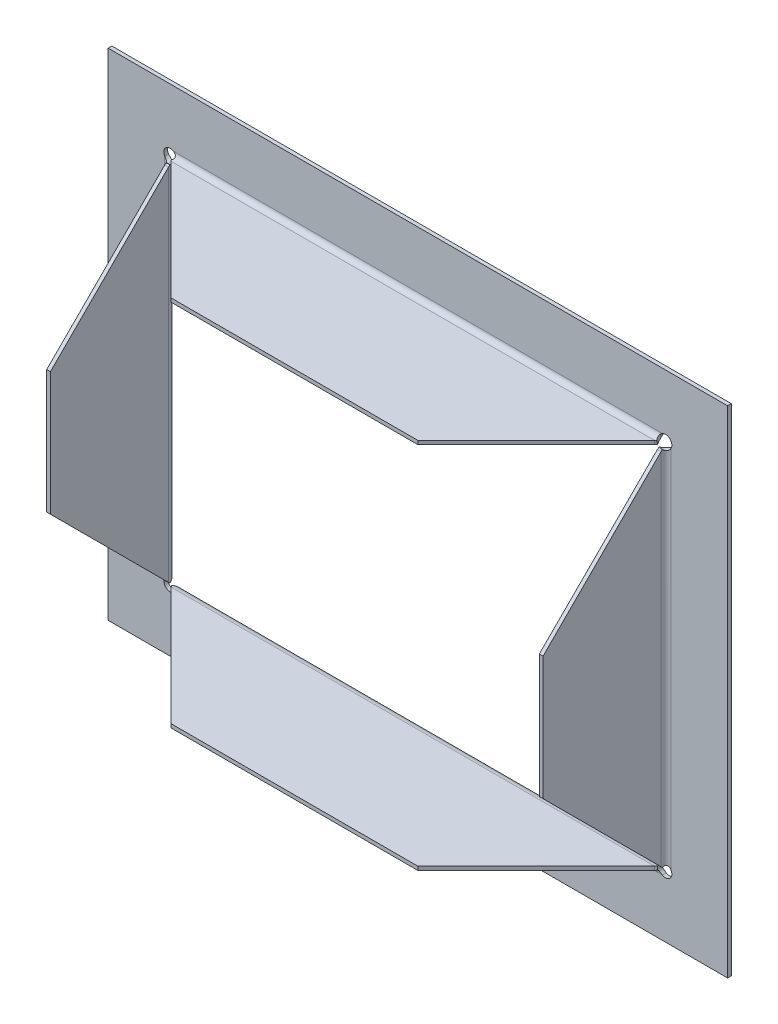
ISO-10303-21;
HEADER;
FILE_DESCRIPTION(('STEP AP214'),'2;1');
FILE_NAME('part.step','',(''),(''),'','','');
FILE_SCHEMA(('AUTOMOTIVE_DESIGN { 1 0 10303 214 1 1 1 1 }'));
ENDSEC;
DATA;
#1=APPLICATION_CONTEXT('core data for automotive mechanical design processes');
#2=APPLICATION_PROTOCOL_DEFINITION('international standard','automotive_design',2000,#1);
#3=PRODUCT_CONTEXT('',#1,'mechanical');
#4=PRODUCT('Part','Part','',(#3));
#5=PRODUCT_RELATED_PRODUCT_CATEGORY('part','',(#4));
#6=PRODUCT_DEFINITION_FORMATION('','',#4);
#7=PRODUCT_DEFINITION_CONTEXT('part definition',#1,'design');
#8=PRODUCT_DEFINITION('design','',#6,#7);
#9=PRODUCT_DEFINITION_SHAPE('','',#8);
#10=(LENGTH_UNIT() NAMED_UNIT(*) SI_UNIT(.MILLI.,.METRE.));
#11=(NAMED_UNIT(*) PLANE_ANGLE_UNIT() SI_UNIT($,.RADIAN.));
#12=(NAMED_UNIT(*) SI_UNIT($,.STERADIAN.) SOLID_ANGLE_UNIT());
#13=UNCERTAINTY_MEASURE_WITH_UNIT(LENGTH_MEASURE(1.E-05),#10,'distance_accuracy_value','');
#14=(GEOMETRIC_REPRESENTATION_CONTEXT(3) GLOBAL_UNCERTAINTY_ASSIGNED_CONTEXT((#13)) GLOBAL_UNIT_ASSIGNED_CONTEXT((#10,
#11,#12)) REPRESENTATION_CONTEXT('',''));
#15=CARTESIAN_POINT('',(0.,0.,0.));
#16=DIRECTION('',(0.,0.,1.));
#17=DIRECTION('',(1.,0.,0.));
#18=AXIS2_PLACEMENT_3D('',#15,#16,#17);
#19=CARTESIAN_POINT('',(-125.,-100.,1.5));
#20=DIRECTION('',(0.,0.,1.));
#21=DIRECTION('',(1.,0.,0.));
#22=AXIS2_PLACEMENT_3D('',#19,#20,#21);
#23=PLANE('',#22);
#24=DIRECTION('',(0.,-1.,0.));
#25=VECTOR('',#24,1.);
#26=CARTESIAN_POINT('',(-125.,100.,1.5));
#27=LINE('',#26,#25);
#28=CARTESIAN_POINT('',(-125.,100.,1.5));
#29=VERTEX_POINT('',#28);
#30=CARTESIAN_POINT('',(-125.,-100.,1.5));
#31=VERTEX_POINT('',#30);
#32=EDGE_CURVE('E1361',#29,#31,#27,.T.);
#33=ORIENTED_EDGE('',*,*,#32,.T.);
#34=DIRECTION('',(1.,0.,0.));
#35=VECTOR('',#34,1.);
#36=CARTESIAN_POINT('',(-125.,-100.,1.5));
#37=LINE('',#36,#35);
#38=CARTESIAN_POINT('',(125.,-100.,1.5));
#39=VERTEX_POINT('',#38);
#40=EDGE_CURVE('E1363',#31,#39,#37,.T.);
#41=ORIENTED_EDGE('',*,*,#40,.T.);
#42=DIRECTION('',(0.,1.,0.));
#43=VECTOR('',#42,1.);
#44=CARTESIAN_POINT('',(125.,100.,1.5));
#45=LINE('',#44,#43);
#46=CARTESIAN_POINT('',(125.,100.,1.5));
#47=VERTEX_POINT('',#46);
#48=EDGE_CURVE('E1665',#39,#47,#45,.T.);
#49=ORIENTED_EDGE('',*,*,#48,.T.);
#50=DIRECTION('',(-1.,0.,0.));
#51=VECTOR('',#50,1.);
#52=CARTESIAN_POINT('',(-125.,100.,1.5));
#53=LINE('',#52,#51);
#54=EDGE_CURVE('E1123',#47,#29,#53,.T.);
#55=ORIENTED_EDGE('',*,*,#54,.T.);
#56=EDGE_LOOP('',(#33,#41,#49,#55));
#57=FACE_BOUND('',#56,.T.);
#58=CARTESIAN_POINT('',(100.,-75.,1.5));
#59=DIRECTION('',(0.,0.,1.));
#60=DIRECTION('',(1.,0.,0.));
#61=AXIS2_PLACEMENT_3D('',#58,#59,#60);
#62=CIRCLE('',#61,2.49999999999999);
#63=CARTESIAN_POINT('',(98.7410044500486,-77.159844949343,1.5));
#64=VERTEX_POINT('',#63);
#65=CARTESIAN_POINT('',(102.159844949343,-73.7410044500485,1.50000007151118));
#66=VERTEX_POINT('',#65);
#67=EDGE_CURVE('E677',#64,#66,#62,.T.);
#68=ORIENTED_EDGE('',*,*,#67,.F.);
#69=DIRECTION('',(-1.,0.,0.));
#70=VECTOR('',#69,1.);
#71=CARTESIAN_POINT('',(-125.,-77.159844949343,1.5));
#72=LINE('',#71,#70);
#73=CARTESIAN_POINT('',(-98.7410044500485,-77.159844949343,1.50000005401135));
#74=VERTEX_POINT('',#73);
#75=EDGE_CURVE('E830',#64,#74,#72,.T.);
#76=ORIENTED_EDGE('',*,*,#75,.T.);
#77=CARTESIAN_POINT('',(-100.,-75.,1.5));
#78=DIRECTION('',(0.,0.,1.));
#79=DIRECTION('',(-1.,0.,0.));
#80=AXIS2_PLACEMENT_3D('',#77,#78,#79);
#81=CIRCLE('',#80,2.49999999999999);
#82=CARTESIAN_POINT('',(-102.159844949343,-73.7410044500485,1.5));
#83=VERTEX_POINT('',#82);
#84=EDGE_CURVE('E862',#83,#74,#81,.T.);
#85=ORIENTED_EDGE('',*,*,#84,.F.);
#86=DIRECTION('',(0.,1.,0.));
#87=VECTOR('',#86,1.);
#88=CARTESIAN_POINT('',(-102.159844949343,-100.,1.5));
#89=LINE('',#88,#87);
#90=CARTESIAN_POINT('',(-102.159844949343,73.7410044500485,1.50000007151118));
#91=VERTEX_POINT('',#90);
#92=EDGE_CURVE('E1119',#83,#91,#89,.T.);
#93=ORIENTED_EDGE('',*,*,#92,.T.);
#94=CARTESIAN_POINT('',(-100.,75.,1.5));
#95=DIRECTION('',(0.,0.,1.));
#96=DIRECTION('',(1.,0.,0.));
#97=AXIS2_PLACEMENT_3D('',#94,#95,#96);
#98=CIRCLE('',#97,2.49999999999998);
#99=CARTESIAN_POINT('',(-98.7410044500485,77.159844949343,1.50000005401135));
#100=VERTEX_POINT('',#99);
#101=EDGE_CURVE('E1117',#100,#91,#98,.T.);
#102=ORIENTED_EDGE('',*,*,#101,.F.);
#103=DIRECTION('',(-1.,0.,0.));
#104=VECTOR('',#103,1.);
#105=CARTESIAN_POINT('',(-125.,77.159844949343,1.5));
#106=LINE('',#105,#104);
#107=CARTESIAN_POINT('',(98.7410044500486,77.159844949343,1.50000005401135));
#108=VERTEX_POINT('',#107);
#109=EDGE_CURVE('E726',#108,#100,#106,.T.);
#110=ORIENTED_EDGE('',*,*,#109,.F.);
#111=CARTESIAN_POINT('',(100.,75.,1.5));
#112=DIRECTION('',(0.,0.,1.));
#113=DIRECTION('',(-1.,0.,0.));
#114=AXIS2_PLACEMENT_3D('',#111,#112,#113);
#115=CIRCLE('',#114,2.49999999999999);
#116=CARTESIAN_POINT('',(102.159844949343,73.7410044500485,1.50000007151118));
#117=VERTEX_POINT('',#116);
#118=EDGE_CURVE('E679',#117,#108,#115,.T.);
#119=ORIENTED_EDGE('',*,*,#118,.F.);
#120=DIRECTION('',(0.,1.,0.));
#121=VECTOR('',#120,1.);
#122=CARTESIAN_POINT('',(102.159844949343,-100.,1.5));
#123=LINE('',#122,#121);
#124=EDGE_CURVE('E663',#66,#117,#123,.T.);
#125=ORIENTED_EDGE('',*,*,#124,.F.);
#126=EDGE_LOOP('',(#68,#76,#85,#93,#102,#110,#119,#125));
#127=FACE_BOUND('',#126,.T.);
#128=ADVANCED_FACE('F146',(#57,#127),#23,.T.);
#129=CARTESIAN_POINT('',(100.,-75.,0.));
#130=DIRECTION('',(0.,0.,1.));
#131=DIRECTION('',(1.,0.,0.));
#132=AXIS2_PLACEMENT_3D('',#129,#130,#131);
#133=CYLINDRICAL_SURFACE('',#132,2.49999999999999);
#134=CARTESIAN_POINT('',(98.7410044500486,-77.159844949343,1.50000005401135));
#135=CARTESIAN_POINT('',(98.7410044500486,-77.159844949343,5.40113548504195E-08));
#136=B_SPLINE_CURVE_WITH_KNOTS('',1,(#134,#135),.UNSPECIFIED.,.F.,.F.,(2,2),(0.,1.),.UNSPECIFIED.);
#137=CARTESIAN_POINT('',(98.7410044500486,-77.159844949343,0.));
#138=VERTEX_POINT('',#137);
#139=EDGE_CURVE('E497',#64,#138,#136,.T.);
#140=ORIENTED_EDGE('',*,*,#139,.F.);
#141=ORIENTED_EDGE('',*,*,#67,.T.);
#142=CARTESIAN_POINT('',(102.159844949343,-73.7410044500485,7.15111810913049E-08));
#143=CARTESIAN_POINT('',(102.159844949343,-73.7410044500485,1.50000007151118));
#144=B_SPLINE_CURVE_WITH_KNOTS('',1,(#142,#143),.UNSPECIFIED.,.F.,.F.,(2,2),(0.,1.),.UNSPECIFIED.);
#145=CARTESIAN_POINT('',(102.159844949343,-73.7410044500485,0.));
#146=VERTEX_POINT('',#145);
#147=EDGE_CURVE('E826',#66,#146,#144,.F.);
#148=ORIENTED_EDGE('',*,*,#147,.T.);
#149=CARTESIAN_POINT('',(100.,-75.,0.));
#150=DIRECTION('',(0.,0.,1.));
#151=DIRECTION('',(1.,0.,0.));
#152=AXIS2_PLACEMENT_3D('',#149,#150,#151);
#153=CIRCLE('',#152,2.49999999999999);
#154=EDGE_CURVE('E172',#138,#146,#153,.T.);
#155=ORIENTED_EDGE('',*,*,#154,.F.);
#156=EDGE_LOOP('',(#140,#141,#148,#155));
#157=FACE_BOUND('',#156,.T.);
#158=ADVANCED_FACE('F713',(#157),#133,.F.);
#159=CARTESIAN_POINT('',(100.,75.,0.));
#160=DIRECTION('',(0.,0.,1.));
#161=DIRECTION('',(1.,0.,0.));
#162=AXIS2_PLACEMENT_3D('',#159,#160,#161);
#163=CYLINDRICAL_SURFACE('',#162,2.49999999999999);
#164=CARTESIAN_POINT('',(100.,75.,0.));
#165=DIRECTION('',(0.,0.,1.));
#166=DIRECTION('',(-1.,0.,0.));
#167=AXIS2_PLACEMENT_3D('',#164,#165,#166);
#168=CIRCLE('',#167,2.49999999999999);
#169=CARTESIAN_POINT('',(102.159844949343,73.7410044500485,7.15111810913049E-08));
#170=VERTEX_POINT('',#169);
#171=CARTESIAN_POINT('',(98.7410044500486,77.159844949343,0.));
#172=VERTEX_POINT('',#171);
#173=EDGE_CURVE('E811',#170,#172,#168,.T.);
#174=ORIENTED_EDGE('',*,*,#173,.F.);
#175=CARTESIAN_POINT('',(102.159844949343,73.7410044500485,1.50000007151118));
#176=CARTESIAN_POINT('',(102.159844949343,73.7410044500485,7.15111810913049E-08));
#177=B_SPLINE_CURVE_WITH_KNOTS('',1,(#175,#176),.UNSPECIFIED.,.F.,.F.,(2,2),(0.,1.),.UNSPECIFIED.);
#178=EDGE_CURVE('E681',#170,#117,#177,.F.);
#179=ORIENTED_EDGE('',*,*,#178,.T.);
#180=ORIENTED_EDGE('',*,*,#118,.T.);
#181=CARTESIAN_POINT('',(98.7410044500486,77.159844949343,5.40113548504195E-08));
#182=CARTESIAN_POINT('',(98.7410044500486,77.159844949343,1.50000005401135));
#183=B_SPLINE_CURVE_WITH_KNOTS('',1,(#181,#182),.UNSPECIFIED.,.F.,.F.,(2,2),(0.,1.),.UNSPECIFIED.);
#184=EDGE_CURVE('E682',#108,#172,#183,.F.);
#185=ORIENTED_EDGE('',*,*,#184,.T.);
#186=EDGE_LOOP('',(#174,#179,#180,#185));
#187=FACE_BOUND('',#186,.T.);
#188=ADVANCED_FACE('F704',(#187),#163,.F.);
#189=CARTESIAN_POINT('',(-125.,-100.,0.));
#190=DIRECTION('',(0.,0.,1.));
#191=DIRECTION('',(1.,0.,0.));
#192=AXIS2_PLACEMENT_3D('',#189,#190,#191);
#193=PLANE('',#192);
#194=DIRECTION('',(-1.,0.,0.));
#195=VECTOR('',#194,1.);
#196=CARTESIAN_POINT('',(-125.,-77.159844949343,0.));
#197=LINE('',#196,#195);
#198=CARTESIAN_POINT('',(-98.7410044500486,-77.159844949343,0.));
#199=VERTEX_POINT('',#198);
#200=EDGE_CURVE('E157',#138,#199,#197,.T.);
#201=ORIENTED_EDGE('',*,*,#200,.F.);
#202=ORIENTED_EDGE('',*,*,#154,.T.);
#203=DIRECTION('',(0.,1.,0.));
#204=VECTOR('',#203,1.);
#205=CARTESIAN_POINT('',(102.159844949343,-100.,0.));
#206=LINE('',#205,#204);
#207=EDGE_CURVE('E684',#146,#170,#206,.T.);
#208=ORIENTED_EDGE('',*,*,#207,.T.);
#209=ORIENTED_EDGE('',*,*,#173,.T.);
#210=DIRECTION('',(-1.,0.,0.));
#211=VECTOR('',#210,1.);
#212=CARTESIAN_POINT('',(-125.,77.159844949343,0.));
#213=LINE('',#212,#211);
#214=CARTESIAN_POINT('',(-98.7410044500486,77.159844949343,5.40113548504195E-08));
#215=VERTEX_POINT('',#214);
#216=EDGE_CURVE('E686',#172,#215,#213,.T.);
#217=ORIENTED_EDGE('',*,*,#216,.T.);
#218=CARTESIAN_POINT('',(-100.,75.,0.));
#219=DIRECTION('',(0.,0.,1.));
#220=DIRECTION('',(1.,0.,0.));
#221=AXIS2_PLACEMENT_3D('',#218,#219,#220);
#222=CIRCLE('',#221,2.49999999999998);
#223=CARTESIAN_POINT('',(-102.159844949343,73.7410044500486,0.));
#224=VERTEX_POINT('',#223);
#225=EDGE_CURVE('E819',#215,#224,#222,.T.);
#226=ORIENTED_EDGE('',*,*,#225,.T.);
#227=DIRECTION('',(0.,1.,0.));
#228=VECTOR('',#227,1.);
#229=CARTESIAN_POINT('',(-102.159844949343,-100.,0.));
#230=LINE('',#229,#228);
#231=CARTESIAN_POINT('',(-102.159844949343,-73.7410044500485,0.));
#232=VERTEX_POINT('',#231);
#233=EDGE_CURVE('E1400',#232,#224,#230,.T.);
#234=ORIENTED_EDGE('',*,*,#233,.F.);
#235=CARTESIAN_POINT('',(-100.,-75.,0.));
#236=DIRECTION('',(0.,0.,1.));
#237=DIRECTION('',(-1.,0.,0.));
#238=AXIS2_PLACEMENT_3D('',#235,#236,#237);
#239=CIRCLE('',#238,2.49999999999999);
#240=EDGE_CURVE('E164',#232,#199,#239,.T.);
#241=ORIENTED_EDGE('',*,*,#240,.T.);
#242=EDGE_LOOP('',(#201,#202,#208,#209,#217,#226,#234,#241));
#243=FACE_BOUND('',#242,.T.);
#244=DIRECTION('',(0.,-1.,0.));
#245=VECTOR('',#244,1.);
#246=CARTESIAN_POINT('',(-125.,100.,0.));
#247=LINE('',#246,#245);
#248=CARTESIAN_POINT('',(-125.,100.,0.));
#249=VERTEX_POINT('',#248);
#250=CARTESIAN_POINT('',(-125.,-100.,0.));
#251=VERTEX_POINT('',#250);
#252=EDGE_CURVE('E1375',#249,#251,#247,.T.);
#253=ORIENTED_EDGE('',*,*,#252,.F.);
#254=DIRECTION('',(-1.,0.,0.));
#255=VECTOR('',#254,1.);
#256=CARTESIAN_POINT('',(-125.,100.,0.));
#257=LINE('',#256,#255);
#258=CARTESIAN_POINT('',(125.,100.,0.));
#259=VERTEX_POINT('',#258);
#260=EDGE_CURVE('E1391',#259,#249,#257,.T.);
#261=ORIENTED_EDGE('',*,*,#260,.F.);
#262=DIRECTION('',(0.,1.,0.));
#263=VECTOR('',#262,1.);
#264=CARTESIAN_POINT('',(125.,100.,0.));
#265=LINE('',#264,#263);
#266=CARTESIAN_POINT('',(125.,-100.,0.));
#267=VERTEX_POINT('',#266);
#268=EDGE_CURVE('E1386',#267,#259,#265,.T.);
#269=ORIENTED_EDGE('',*,*,#268,.F.);
#270=DIRECTION('',(1.,0.,0.));
#271=VECTOR('',#270,1.);
#272=CARTESIAN_POINT('',(-125.,-100.,0.));
#273=LINE('',#272,#271);
#274=EDGE_CURVE('E1377',#251,#267,#273,.T.);
#275=ORIENTED_EDGE('',*,*,#274,.F.);
#276=EDGE_LOOP('',(#253,#261,#269,#275));
#277=FACE_BOUND('',#276,.T.);
#278=ADVANCED_FACE('F148',(#243,#277),#193,.F.);
#279=CARTESIAN_POINT('',(-100.,75.,0.));
#280=DIRECTION('',(0.,0.,1.));
#281=DIRECTION('',(1.,0.,0.));
#282=AXIS2_PLACEMENT_3D('',#279,#280,#281);
#283=CYLINDRICAL_SURFACE('',#282,2.49999999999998);
#284=ORIENTED_EDGE('',*,*,#225,.F.);
#285=CARTESIAN_POINT('',(-98.7410044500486,77.159844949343,1.50000005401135));
#286=CARTESIAN_POINT('',(-98.7410044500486,77.159844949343,5.40113548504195E-08));
#287=B_SPLINE_CURVE_WITH_KNOTS('',1,(#285,#286),.UNSPECIFIED.,.F.,.F.,(2,2),(0.,1.),.UNSPECIFIED.);
#288=EDGE_CURVE('E733',#215,#100,#287,.F.);
#289=ORIENTED_EDGE('',*,*,#288,.T.);
#290=ORIENTED_EDGE('',*,*,#101,.T.);
#291=CARTESIAN_POINT('',(-102.159844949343,73.7410044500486,7.15111810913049E-08));
#292=CARTESIAN_POINT('',(-102.159844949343,73.7410044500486,1.50000007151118));
#293=B_SPLINE_CURVE_WITH_KNOTS('',1,(#291,#292),.UNSPECIFIED.,.F.,.F.,(2,2),(0.,1.),.UNSPECIFIED.);
#294=EDGE_CURVE('E880',#224,#91,#293,.T.);
#295=ORIENTED_EDGE('',*,*,#294,.F.);
#296=EDGE_LOOP('',(#284,#289,#290,#295));
#297=FACE_BOUND('',#296,.T.);
#298=ADVANCED_FACE('F714',(#297),#283,.F.);
#299=CARTESIAN_POINT('',(-98.659844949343,73.0964776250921,2.96083471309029));
#300=DIRECTION('',(0.,-0.707106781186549,-0.707106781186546));
#301=DIRECTION('',(0.,-0.707106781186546,0.707106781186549));
#302=AXIS2_PLACEMENT_3D('',#299,#300,#301);
#303=PLANE('',#302);
#304=DIRECTION('',(0.,-0.707106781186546,0.707106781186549));
#305=VECTOR('',#304,1.);
#306=CARTESIAN_POINT('',(-98.659844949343,73.0964776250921,2.96083471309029));
#307=LINE('',#306,#305);
#308=CARTESIAN_POINT('',(-98.659844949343,72.5573123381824,3.5));
#309=VERTEX_POINT('',#308);
#310=CARTESIAN_POINT('',(-98.6598449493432,24.9171572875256,51.140155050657));
#311=VERTEX_POINT('',#310);
#312=EDGE_CURVE('E1728',#309,#311,#307,.T.);
#313=ORIENTED_EDGE('',*,*,#312,.F.);
#314=CARTESIAN_POINT('',(-100.159845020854,72.5573123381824,3.50000000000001));
#315=CARTESIAN_POINT('',(-98.6598450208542,72.5573123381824,3.50000000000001));
#316=B_SPLINE_CURVE_WITH_KNOTS('',1,(#314,#315),.UNSPECIFIED.,.F.,.F.,(2,2),(0.,1.),.UNSPECIFIED.);
#317=CARTESIAN_POINT('',(-100.159845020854,72.5573123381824,3.50000000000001));
#318=VERTEX_POINT('',#317);
#319=EDGE_CURVE('E1719',#309,#318,#316,.F.);
#320=ORIENTED_EDGE('',*,*,#319,.T.);
#321=DIRECTION('',(0.,-0.707106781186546,0.707106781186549));
#322=VECTOR('',#321,1.);
#323=CARTESIAN_POINT('',(-100.159844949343,73.0964776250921,2.96083471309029));
#324=LINE('',#323,#322);
#325=CARTESIAN_POINT('',(-100.159844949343,24.9171572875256,51.140155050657));
#326=VERTEX_POINT('',#325);
#327=EDGE_CURVE('E870',#318,#326,#324,.T.);
#328=ORIENTED_EDGE('',*,*,#327,.T.);
#329=DIRECTION('',(-1.,0.,0.));
#330=VECTOR('',#329,1.);
#331=CARTESIAN_POINT('',(-98.6598449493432,24.9171572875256,51.140155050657));
#332=LINE('',#331,#330);
#333=EDGE_CURVE('E1724',#311,#326,#332,.T.);
#334=ORIENTED_EDGE('',*,*,#333,.F.);
#335=EDGE_LOOP('',(#313,#320,#328,#334));
#336=FACE_BOUND('',#335,.T.);
#337=ADVANCED_FACE('F1693',(#336),#303,.F.);
#338=CARTESIAN_POINT('',(-98.659844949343,-73.0964776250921,2.96083471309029));
#339=DIRECTION('',(0.,0.707106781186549,-0.707106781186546));
#340=DIRECTION('',(0.,-0.707106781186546,-0.707106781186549));
#341=AXIS2_PLACEMENT_3D('',#338,#339,#340);
#342=PLANE('',#341);
#343=DIRECTION('',(0.,-0.707106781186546,-0.707106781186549));
#344=VECTOR('',#343,1.);
#345=CARTESIAN_POINT('',(-100.159844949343,-73.0964776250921,2.96083471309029));
#346=LINE('',#345,#344);
#347=CARTESIAN_POINT('',(-100.159844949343,-24.9171572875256,51.140155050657));
#348=VERTEX_POINT('',#347);
#349=CARTESIAN_POINT('',(-100.159844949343,-72.5573123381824,3.5));
#350=VERTEX_POINT('',#349);
#351=EDGE_CURVE('E1730',#348,#350,#346,.T.);
#352=ORIENTED_EDGE('',*,*,#351,.T.);
#353=CARTESIAN_POINT('',(-98.6598450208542,-72.5573123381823,3.50000000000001));
#354=CARTESIAN_POINT('',(-100.159845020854,-72.5573123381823,3.50000000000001));
#355=B_SPLINE_CURVE_WITH_KNOTS('',1,(#353,#354),.UNSPECIFIED.,.F.,.F.,(2,2),(0.,1.),.UNSPECIFIED.);
#356=CARTESIAN_POINT('',(-98.659844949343,-72.5573123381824,3.5));
#357=VERTEX_POINT('',#356);
#358=EDGE_CURVE('E734',#350,#357,#355,.F.);
#359=ORIENTED_EDGE('',*,*,#358,.T.);
#360=DIRECTION('',(0.,-0.707106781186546,-0.707106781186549));
#361=VECTOR('',#360,1.);
#362=CARTESIAN_POINT('',(-98.659844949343,-73.0964776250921,2.96083471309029));
#363=LINE('',#362,#361);
#364=CARTESIAN_POINT('',(-98.6598449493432,-24.9171572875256,51.140155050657));
#365=VERTEX_POINT('',#364);
#366=EDGE_CURVE('E1722',#365,#357,#363,.T.);
#367=ORIENTED_EDGE('',*,*,#366,.F.);
#368=DIRECTION('',(-1.,0.,0.));
#369=VECTOR('',#368,1.);
#370=CARTESIAN_POINT('',(-98.6598449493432,-24.9171572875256,51.140155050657));
#371=LINE('',#370,#369);
#372=EDGE_CURVE('E1740',#365,#348,#371,.T.);
#373=ORIENTED_EDGE('',*,*,#372,.T.);
#374=EDGE_LOOP('',(#352,#359,#367,#373));
#375=FACE_BOUND('',#374,.T.);
#376=ADVANCED_FACE('F1697',(#375),#342,.F.);
#377=CARTESIAN_POINT('',(-98.6598449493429,-100.,-23.659844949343));
#378=DIRECTION('',(-1.,0.,0.));
#379=DIRECTION('',(0.,0.,1.));
#380=AXIS2_PLACEMENT_3D('',#377,#378,#379);
#381=PLANE('',#380);
#382=ORIENTED_EDGE('',*,*,#366,.T.);
#383=DIRECTION('',(0.,1.,0.));
#384=VECTOR('',#383,1.);
#385=CARTESIAN_POINT('',(-98.659844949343,-100.,3.5));
#386=LINE('',#385,#384);
#387=EDGE_CURVE('E1711',#357,#309,#386,.T.);
#388=ORIENTED_EDGE('',*,*,#387,.T.);
#389=ORIENTED_EDGE('',*,*,#312,.T.);
#390=DIRECTION('',(0.,-1.,0.));
#391=VECTOR('',#390,1.);
#392=CARTESIAN_POINT('',(-98.6598449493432,24.9171572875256,51.140155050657));
#393=LINE('',#392,#391);
#394=EDGE_CURVE('E1725',#311,#365,#393,.T.);
#395=ORIENTED_EDGE('',*,*,#394,.T.);
#396=EDGE_LOOP('',(#382,#388,#389,#395));
#397=FACE_BOUND('',#396,.T.);
#398=ADVANCED_FACE('F1687',(#397),#381,.F.);
#399=CARTESIAN_POINT('',(-100.159844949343,-100.,-23.659844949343));
#400=DIRECTION('',(-1.,0.,0.));
#401=DIRECTION('',(0.,0.,1.));
#402=AXIS2_PLACEMENT_3D('',#399,#400,#401);
#403=PLANE('',#402);
#404=DIRECTION('',(0.,1.,0.));
#405=VECTOR('',#404,1.);
#406=CARTESIAN_POINT('',(-100.159844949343,-100.,3.5));
#407=LINE('',#406,#405);
#408=EDGE_CURVE('E1735',#350,#318,#407,.T.);
#409=ORIENTED_EDGE('',*,*,#408,.F.);
#410=ORIENTED_EDGE('',*,*,#351,.F.);
#411=DIRECTION('',(0.,-1.,0.));
#412=VECTOR('',#411,1.);
#413=CARTESIAN_POINT('',(-100.159844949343,24.9171572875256,51.140155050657));
#414=LINE('',#413,#412);
#415=EDGE_CURVE('E871',#326,#348,#414,.T.);
#416=ORIENTED_EDGE('',*,*,#415,.F.);
#417=ORIENTED_EDGE('',*,*,#327,.F.);
#418=EDGE_LOOP('',(#409,#410,#416,#417));
#419=FACE_BOUND('',#418,.T.);
#420=ADVANCED_FACE('F1681',(#419),#403,.T.);
#421=CARTESIAN_POINT('',(-98.6598449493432,24.9171572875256,51.140155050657));
#422=DIRECTION('',(0.,0.,-1.));
#423=DIRECTION('',(-1.,0.,0.));
#424=AXIS2_PLACEMENT_3D('',#421,#422,#423);
#425=PLANE('',#424);
#426=ORIENTED_EDGE('',*,*,#415,.T.);
#427=ORIENTED_EDGE('',*,*,#372,.F.);
#428=ORIENTED_EDGE('',*,*,#394,.F.);
#429=ORIENTED_EDGE('',*,*,#333,.T.);
#430=EDGE_LOOP('',(#426,#427,#428,#429));
#431=FACE_BOUND('',#430,.T.);
#432=ADVANCED_FACE('F1676',(#431),#425,.F.);
#433=CARTESIAN_POINT('',(-125.,100.,1.5));
#434=DIRECTION('',(0.,-1.,0.));
#435=DIRECTION('',(0.,0.,-1.));
#436=AXIS2_PLACEMENT_3D('',#433,#434,#435);
#437=PLANE('',#436);
#438=ORIENTED_EDGE('',*,*,#260,.T.);
#439=DIRECTION('',(0.,0.,-1.));
#440=VECTOR('',#439,1.);
#441=CARTESIAN_POINT('',(-125.,100.,1.5));
#442=LINE('',#441,#440);
#443=EDGE_CURVE('E1369',#29,#249,#442,.T.);
#444=ORIENTED_EDGE('',*,*,#443,.F.);
#445=ORIENTED_EDGE('',*,*,#54,.F.);
#446=DIRECTION('',(0.,0.,-1.));
#447=VECTOR('',#446,1.);
#448=CARTESIAN_POINT('',(125.,100.,1.5));
#449=LINE('',#448,#447);
#450=EDGE_CURVE('E1388',#47,#259,#449,.T.);
#451=ORIENTED_EDGE('',*,*,#450,.T.);
#452=EDGE_LOOP('',(#438,#444,#445,#451));
#453=FACE_BOUND('',#452,.T.);
#454=ADVANCED_FACE('F1623',(#453),#437,.F.);
#455=CARTESIAN_POINT('',(125.,100.,1.5));
#456=DIRECTION('',(-1.,0.,0.));
#457=DIRECTION('',(0.,-1.,0.));
#458=AXIS2_PLACEMENT_3D('',#455,#456,#457);
#459=PLANE('',#458);
#460=ORIENTED_EDGE('',*,*,#268,.T.);
#461=ORIENTED_EDGE('',*,*,#450,.F.);
#462=ORIENTED_EDGE('',*,*,#48,.F.);
#463=DIRECTION('',(0.,0.,-1.));
#464=VECTOR('',#463,1.);
#465=CARTESIAN_POINT('',(125.,-100.,1.5));
#466=LINE('',#465,#464);
#467=EDGE_CURVE('E1380',#39,#267,#466,.T.);
#468=ORIENTED_EDGE('',*,*,#467,.T.);
#469=EDGE_LOOP('',(#460,#461,#462,#468));
#470=FACE_BOUND('',#469,.T.);
#471=ADVANCED_FACE('F1673',(#470),#459,.F.);
#472=CARTESIAN_POINT('',(-125.,-100.,1.5));
#473=DIRECTION('',(0.,1.,0.));
#474=DIRECTION('',(0.,0.,1.));
#475=AXIS2_PLACEMENT_3D('',#472,#473,#474);
#476=PLANE('',#475);
#477=ORIENTED_EDGE('',*,*,#274,.T.);
#478=ORIENTED_EDGE('',*,*,#467,.F.);
#479=ORIENTED_EDGE('',*,*,#40,.F.);
#480=DIRECTION('',(0.,0.,-1.));
#481=VECTOR('',#480,1.);
#482=CARTESIAN_POINT('',(-125.,-100.,1.5));
#483=LINE('',#482,#481);
#484=EDGE_CURVE('E1373',#31,#251,#483,.T.);
#485=ORIENTED_EDGE('',*,*,#484,.T.);
#486=EDGE_LOOP('',(#477,#478,#479,#485));
#487=FACE_BOUND('',#486,.T.);
#488=ADVANCED_FACE('F1670',(#487),#476,.F.);
#489=CARTESIAN_POINT('',(-125.,100.,1.5));
#490=DIRECTION('',(1.,0.,0.));
#491=DIRECTION('',(0.,1.,0.));
#492=AXIS2_PLACEMENT_3D('',#489,#490,#491);
#493=PLANE('',#492);
#494=ORIENTED_EDGE('',*,*,#252,.T.);
#495=ORIENTED_EDGE('',*,*,#484,.F.);
#496=ORIENTED_EDGE('',*,*,#32,.F.);
#497=ORIENTED_EDGE('',*,*,#443,.T.);
#498=EDGE_LOOP('',(#494,#495,#496,#497));
#499=FACE_BOUND('',#498,.T.);
#500=ADVANCED_FACE('F853',(#499),#493,.F.);
#501=CARTESIAN_POINT('',(-100.,-75.,0.));
#502=DIRECTION('',(0.,0.,1.));
#503=DIRECTION('',(1.,0.,0.));
#504=AXIS2_PLACEMENT_3D('',#501,#502,#503);
#505=CYLINDRICAL_SURFACE('',#504,2.49999999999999);
#506=CARTESIAN_POINT('',(-98.7410044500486,-77.159844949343,5.40113548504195E-08));
#507=CARTESIAN_POINT('',(-98.7410044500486,-77.159844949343,1.50000005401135));
#508=B_SPLINE_CURVE_WITH_KNOTS('',1,(#506,#507),.UNSPECIFIED.,.F.,.F.,(2,2),(0.,1.),.UNSPECIFIED.);
#509=EDGE_CURVE('E12',#199,#74,#508,.T.);
#510=ORIENTED_EDGE('',*,*,#509,.F.);
#511=ORIENTED_EDGE('',*,*,#240,.F.);
#512=CARTESIAN_POINT('',(-102.159844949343,-73.7410044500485,1.50000007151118));
#513=CARTESIAN_POINT('',(-102.159844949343,-73.7410044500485,7.15111810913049E-08));
#514=B_SPLINE_CURVE_WITH_KNOTS('',1,(#512,#513),.UNSPECIFIED.,.F.,.F.,(2,2),(0.,1.),.UNSPECIFIED.);
#515=EDGE_CURVE('E1407',#83,#232,#514,.T.);
#516=ORIENTED_EDGE('',*,*,#515,.F.);
#517=ORIENTED_EDGE('',*,*,#84,.T.);
#518=EDGE_LOOP('',(#510,#511,#516,#517));
#519=FACE_BOUND('',#518,.T.);
#520=ADVANCED_FACE('F844',(#519),#505,.F.);
#521=CARTESIAN_POINT('',(-102.159844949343,-73.7410044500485,7.15111810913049E-08));
#522=CARTESIAN_POINT('',(-101.897230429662,-73.4195476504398,7.15111811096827E-08));
#523=CARTESIAN_POINT('',(-101.590141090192,-73.159597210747,0.0291842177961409));
#524=CARTESIAN_POINT('',(-100.91779838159,-72.7643702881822,0.209339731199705));
#525=CARTESIAN_POINT('',(-100.553106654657,-72.6290978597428,0.360333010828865));
#526=CARTESIAN_POINT('',(-99.8336150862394,-72.4815495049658,0.849005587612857));
#527=CARTESIAN_POINT('',(-99.5116972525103,-72.4897585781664,1.16690386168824));
#528=CARTESIAN_POINT('',(-99.0041705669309,-72.6701432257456,1.9195750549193));
#529=CARTESIAN_POINT('',(-98.8190817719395,-72.8421684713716,2.3540415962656));
#530=CARTESIAN_POINT('',(-98.7268990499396,-73.0964776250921,2.81817747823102));
#531=CARTESIAN_POINT('',(-102.159844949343,-73.7410044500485,1.50000007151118));
#532=CARTESIAN_POINT('',(-102.009708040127,-73.4193945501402,1.50000007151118));
#533=CARTESIAN_POINT('',(-101.83429989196,-73.159597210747,1.51667672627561));
#534=CARTESIAN_POINT('',(-101.45010406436,-72.7643702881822,1.61962273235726));
#535=CARTESIAN_POINT('',(-101.24170879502,-72.6290978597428,1.7059046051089));
#536=CARTESIAN_POINT('',(-100.830570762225,-72.4815495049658,1.98514607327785));
#537=CARTESIAN_POINT('',(-100.646617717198,-72.4897585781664,2.16680222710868));
#538=CARTESIAN_POINT('',(-100.35660247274,-72.6701432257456,2.5969000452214));
#539=CARTESIAN_POINT('',(-100.250827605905,-72.8422159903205,2.84521619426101));
#540=CARTESIAN_POINT('',(-100.198161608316,-73.0964776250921,3.11038713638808));
#541=B_SPLINE_SURFACE_WITH_KNOTS('',1,3,((#521,#522,#523,#524,#525,#526,#527,#528,#529,#530),
(#531,#532,#533,#534,#535,#536,#537,#538,#539,#540)),.UNSPECIFIED.,.F.,.F.,.F.,(2,2),(4,2,2,2,
4),(0.,1.),(0.,0.25,0.5,0.75,1.),.UNSPECIFIED.);
#542=CARTESIAN_POINT('',(-102.159844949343,-73.7410044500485,7.15111810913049E-08));
#543=CARTESIAN_POINT('',(-101.897230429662,-73.4195476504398,7.15111811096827E-08));
#544=CARTESIAN_POINT('',(-101.590141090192,-73.159597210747,0.0291842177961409));
#545=CARTESIAN_POINT('',(-100.91779838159,-72.7643702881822,0.209339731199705));
#546=CARTESIAN_POINT('',(-100.553106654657,-72.6290978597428,0.360333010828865));
#547=CARTESIAN_POINT('',(-99.8336150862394,-72.4815495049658,0.849005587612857));
#548=CARTESIAN_POINT('',(-99.5116972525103,-72.4897585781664,1.16690386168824));
#549=CARTESIAN_POINT('',(-99.0041705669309,-72.6701432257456,1.9195750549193));
#550=CARTESIAN_POINT('',(-98.8190817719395,-72.8421684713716,2.3540415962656));
#551=CARTESIAN_POINT('',(-98.7268990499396,-73.0964776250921,2.81817747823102));
#552=B_SPLINE_CURVE_WITH_KNOTS('',3,(#542,#543,#544,#545,#546,#547,#548,#549,#550,#551),
.UNSPECIFIED.,.F.,.F.,(4,2,2,2,4),(0.,0.25,0.5,0.75,1.),.UNSPECIFIED.);
#553=CARTESIAN_POINT('',(-98.7268991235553,-73.0964774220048,2.81817710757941));
#554=VERTEX_POINT('',#553);
#555=EDGE_CURVE('E1458',#232,#554,#552,.T.);
#556=CARTESIAN_POINT('',(-98.7268990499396,-73.0964776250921,2.81817747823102));
#557=CARTESIAN_POINT('',(-100.198161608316,-73.0964776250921,3.11038713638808));
#558=B_SPLINE_CURVE_WITH_KNOTS('',1,(#556,#557),.UNSPECIFIED.,.F.,.F.,(2,2),(0.,1.),.UNSPECIFIED.);
#559=CARTESIAN_POINT('',(-100.198161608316,-73.0964776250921,3.11038713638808));
#560=VERTEX_POINT('',#559);
#561=EDGE_CURVE('E1414',#554,#560,#558,.T.);
#562=CARTESIAN_POINT('',(-100.198161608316,-73.0964776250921,3.11038713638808));
#563=CARTESIAN_POINT('',(-100.250827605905,-72.8422159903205,2.84521619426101));
#564=CARTESIAN_POINT('',(-100.35660247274,-72.6701432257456,2.5969000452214));
#565=CARTESIAN_POINT('',(-100.646617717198,-72.4897585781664,2.16680222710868));
#566=CARTESIAN_POINT('',(-100.830570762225,-72.4815495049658,1.98514607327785));
#567=CARTESIAN_POINT('',(-101.24170879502,-72.6290978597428,1.7059046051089));
#568=CARTESIAN_POINT('',(-101.45010406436,-72.7643702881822,1.61962273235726));
#569=CARTESIAN_POINT('',(-101.83429989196,-73.159597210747,1.51667672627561));
#570=CARTESIAN_POINT('',(-102.009708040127,-73.4193945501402,1.50000007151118));
#571=CARTESIAN_POINT('',(-102.159844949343,-73.7410044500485,1.50000007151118));
#572=B_SPLINE_CURVE_WITH_KNOTS('',3,(#562,#563,#564,#565,#566,#567,#568,#569,#570,#571),
.UNSPECIFIED.,.F.,.F.,(4,2,2,2,4),(0.,0.25,0.5,0.75,1.),.UNSPECIFIED.);
#573=EDGE_CURVE('E1443',#83,#560,#572,.F.);
#574=ORIENTED_EDGE('',*,*,#515,.T.);
#575=ORIENTED_EDGE('',*,*,#555,.T.);
#576=ORIENTED_EDGE('',*,*,#561,.T.);
#577=ORIENTED_EDGE('',*,*,#573,.F.);
#578=EDGE_LOOP('',(#574,#575,#576,#577));
#579=FACE_BOUND('',#578,.T.);
#580=ADVANCED_FACE('F852',(#579),#541,.F.);
#581=CARTESIAN_POINT('',(-98.7268990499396,-73.0964776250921,2.81817747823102));
#582=CARTESIAN_POINT('',(-98.6823384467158,-72.9167510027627,3.04253812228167));
#583=CARTESIAN_POINT('',(-98.6598450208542,-72.7370389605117,3.27125703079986));
#584=CARTESIAN_POINT('',(-98.6598450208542,-72.5573123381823,3.50000000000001));
#585=CARTESIAN_POINT('',(-100.198161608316,-73.0964776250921,3.11038713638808));
#586=CARTESIAN_POINT('',(-100.172698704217,-72.9167531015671,3.23859171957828));
#587=CARTESIAN_POINT('',(-100.159845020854,-72.7370368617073,3.36929126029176));
#588=CARTESIAN_POINT('',(-100.159845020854,-72.5573123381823,3.50000000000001));
#589=B_SPLINE_SURFACE_WITH_KNOTS('',1,3,((#581,#582,#583,#584),(#585,#586,#587,#588)),
.UNSPECIFIED.,.F.,.F.,.F.,(2,2),(4,4),(0.,1.),(0.,1.),.UNSPECIFIED.);
#590=CARTESIAN_POINT('',(-98.7268990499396,-73.0964776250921,2.81817747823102));
#591=CARTESIAN_POINT('',(-98.6823384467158,-72.9167510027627,3.04253812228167));
#592=CARTESIAN_POINT('',(-98.6598450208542,-72.7370389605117,3.27125703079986));
#593=CARTESIAN_POINT('',(-98.6598450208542,-72.5573123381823,3.50000000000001));
#594=B_SPLINE_CURVE_WITH_KNOTS('',3,(#590,#591,#592,#593),.UNSPECIFIED.,.F.,.F.,(4,4),(0.,1.),.UNSPECIFIED.);
#595=EDGE_CURVE('E1453',#554,#357,#594,.T.);
#596=CARTESIAN_POINT('',(-100.159845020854,-72.5573123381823,3.50000000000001));
#597=CARTESIAN_POINT('',(-100.159845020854,-72.7370368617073,3.36929126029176));
#598=CARTESIAN_POINT('',(-100.172698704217,-72.9167531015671,3.23859171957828));
#599=CARTESIAN_POINT('',(-100.198161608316,-73.0964776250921,3.11038713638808));
#600=B_SPLINE_CURVE_WITH_KNOTS('',3,(#596,#597,#598,#599),.UNSPECIFIED.,.F.,.F.,(4,4),(0.,1.),.UNSPECIFIED.);
#601=EDGE_CURVE('E1437',#560,#350,#600,.F.);
#602=ORIENTED_EDGE('',*,*,#561,.F.);
#603=ORIENTED_EDGE('',*,*,#595,.T.);
#604=ORIENTED_EDGE('',*,*,#358,.F.);
#605=ORIENTED_EDGE('',*,*,#601,.F.);
#606=EDGE_LOOP('',(#602,#603,#604,#605));
#607=FACE_BOUND('',#606,.T.);
#608=ADVANCED_FACE('F1767',(#607),#589,.F.);
#609=CARTESIAN_POINT('',(-98.6598450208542,72.5573123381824,3.50000000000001));
#610=CARTESIAN_POINT('',(-98.6598450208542,72.7370389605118,3.27125703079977));
#611=CARTESIAN_POINT('',(-98.6823384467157,72.9167510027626,3.04253812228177));
#612=CARTESIAN_POINT('',(-98.7268990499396,73.096477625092,2.81817747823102));
#613=CARTESIAN_POINT('',(-100.159845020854,72.5573123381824,3.50000000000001));
#614=CARTESIAN_POINT('',(-100.159845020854,72.7370368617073,3.36929126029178));
#615=CARTESIAN_POINT('',(-100.172698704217,72.9167531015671,3.23859171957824));
#616=CARTESIAN_POINT('',(-100.198161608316,73.096477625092,3.11038713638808));
#617=B_SPLINE_SURFACE_WITH_KNOTS('',1,3,((#609,#610,#611,#612),(#613,#614,#615,#616)),
.UNSPECIFIED.,.F.,.F.,.F.,(2,2),(4,4),(0.,1.),(0.,1.),.UNSPECIFIED.);
#618=CARTESIAN_POINT('',(-98.6598450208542,72.5573123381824,3.50000000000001));
#619=CARTESIAN_POINT('',(-98.6598450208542,72.7370389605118,3.27125703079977));
#620=CARTESIAN_POINT('',(-98.6823384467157,72.9167510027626,3.04253812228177));
#621=CARTESIAN_POINT('',(-98.7268990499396,73.096477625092,2.81817747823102));
#622=B_SPLINE_CURVE_WITH_KNOTS('',3,(#618,#619,#620,#621),.UNSPECIFIED.,.F.,.F.,(4,4),(0.,1.),.UNSPECIFIED.);
#623=CARTESIAN_POINT('',(-98.7268989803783,73.0964773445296,2.81817782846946));
#624=VERTEX_POINT('',#623);
#625=EDGE_CURVE('E1450',#309,#624,#622,.T.);
#626=CARTESIAN_POINT('',(-98.7268990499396,73.096477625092,2.81817747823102));
#627=CARTESIAN_POINT('',(-100.198161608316,73.096477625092,3.11038713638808));
#628=B_SPLINE_CURVE_WITH_KNOTS('',1,(#626,#627),.UNSPECIFIED.,.F.,.F.,(2,2),(0.,1.),.UNSPECIFIED.);
#629=CARTESIAN_POINT('',(-100.198161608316,73.096477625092,3.11038713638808));
#630=VERTEX_POINT('',#629);
#631=EDGE_CURVE('E1419',#624,#630,#628,.T.);
#632=CARTESIAN_POINT('',(-100.198161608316,73.096477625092,3.11038713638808));
#633=CARTESIAN_POINT('',(-100.172698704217,72.9167531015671,3.23859171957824));
#634=CARTESIAN_POINT('',(-100.159845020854,72.7370368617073,3.36929126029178));
#635=CARTESIAN_POINT('',(-100.159845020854,72.5573123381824,3.50000000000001));
#636=B_SPLINE_CURVE_WITH_KNOTS('',3,(#632,#633,#634,#635),.UNSPECIFIED.,.F.,.F.,(4,4),(0.,1.),.UNSPECIFIED.);
#637=EDGE_CURVE('E1430',#318,#630,#636,.F.);
#638=ORIENTED_EDGE('',*,*,#319,.F.);
#639=ORIENTED_EDGE('',*,*,#625,.T.);
#640=ORIENTED_EDGE('',*,*,#631,.T.);
#641=ORIENTED_EDGE('',*,*,#637,.F.);
#642=EDGE_LOOP('',(#638,#639,#640,#641));
#643=FACE_BOUND('',#642,.T.);
#644=ADVANCED_FACE('F1537',(#643),#617,.F.);
#645=CARTESIAN_POINT('',(-98.7268990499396,73.096477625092,2.81817747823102));
#646=CARTESIAN_POINT('',(-98.8089138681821,72.8377531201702,2.40523653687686));
#647=CARTESIAN_POINT('',(-98.9699375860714,72.6630109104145,1.98992749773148));
#648=CARTESIAN_POINT('',(-99.3377659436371,72.5275955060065,1.41737504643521));
#649=CARTESIAN_POINT('',(-99.4812200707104,72.5035331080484,1.23501268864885));
#650=CARTESIAN_POINT('',(-99.7262842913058,72.4990536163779,0.981750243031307));
#651=CARTESIAN_POINT('',(-99.8129339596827,72.5028294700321,0.900713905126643));
#652=CARTESIAN_POINT('',(-99.9499968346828,72.5163967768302,0.785199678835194));
#653=CARTESIAN_POINT('',(-99.9968645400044,72.5222364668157,0.747701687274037));
#654=CARTESIAN_POINT('',(-100.068879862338,72.5329718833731,0.693084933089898));
#655=CARTESIAN_POINT('',(-100.093170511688,72.5368796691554,0.675151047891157));
#656=CARTESIAN_POINT('',(-100.130026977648,72.5432353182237,0.648672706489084));
#657=CARTESIAN_POINT('',(-100.14238254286,72.5454361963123,0.639917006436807));
#658=CARTESIAN_POINT('',(-100.161019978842,72.5488610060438,0.62689093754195));
#659=CARTESIAN_POINT('',(-100.167249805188,72.5500231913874,0.622566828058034));
#660=CARTESIAN_POINT('',(-100.179743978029,72.5523887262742,0.613954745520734));
#661=CARTESIAN_POINT('',(-100.187303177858,72.5538443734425,0.608786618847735));
#662=CARTESIAN_POINT('',(-100.511436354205,72.6170005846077,0.388462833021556));
#663=CARTESIAN_POINT('',(-100.850203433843,72.7469419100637,0.235629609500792));
#664=CARTESIAN_POINT('',(-101.519114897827,73.1423380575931,0.0415697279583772));
#665=CARTESIAN_POINT('',(-101.849372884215,73.4079274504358,7.15111811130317E-08));
#666=CARTESIAN_POINT('',(-102.159844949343,73.7410044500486,7.15111810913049E-08));
#667=CARTESIAN_POINT('',(-100.198161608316,73.096477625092,3.11038713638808));
#668=CARTESIAN_POINT('',(-100.245037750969,72.8376949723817,2.87436785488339));
#669=CARTESIAN_POINT('',(-100.337040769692,72.6630109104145,2.63710144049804));
#670=CARTESIAN_POINT('',(-100.547228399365,72.5275955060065,2.30992861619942));
#671=CARTESIAN_POINT('',(-100.629202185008,72.5035331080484,2.20572155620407));
#672=CARTESIAN_POINT('',(-100.769238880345,72.4990536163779,2.06100016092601));
#673=CARTESIAN_POINT('',(-100.818752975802,72.5028294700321,2.01469368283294));
#674=CARTESIAN_POINT('',(-100.897074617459,72.5163967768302,1.94868555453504));
#675=CARTESIAN_POINT('',(-100.923856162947,72.5222364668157,1.92725813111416));
#676=CARTESIAN_POINT('',(-100.965007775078,72.5329718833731,1.8960485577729));
#677=CARTESIAN_POINT('',(-100.978888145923,72.5368796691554,1.88580062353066));
#678=CARTESIAN_POINT('',(-100.999948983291,72.5432353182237,1.87067014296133));
#679=CARTESIAN_POINT('',(-101.007009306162,72.5454361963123,1.86566688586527));
#680=CARTESIAN_POINT('',(-101.017659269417,72.5488610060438,1.85822341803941));
#681=CARTESIAN_POINT('',(-101.021219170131,72.5500231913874,1.85575249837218));
#682=CARTESIAN_POINT('',(-101.028358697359,72.5523887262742,1.85083130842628));
#683=CARTESIAN_POINT('',(-101.032678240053,72.5538443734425,1.84787809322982));
#684=CARTESIAN_POINT('',(-101.217897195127,72.6170005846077,1.72197878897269));
#685=CARTESIAN_POINT('',(-101.411478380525,72.7469419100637,1.63464551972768));
#686=CARTESIAN_POINT('',(-101.793713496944,73.1423380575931,1.52375416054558));
#687=CARTESIAN_POINT('',(-101.982394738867,73.4078568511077,1.50000007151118));
#688=CARTESIAN_POINT('',(-102.159844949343,73.7410044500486,1.50000007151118));
#689=B_SPLINE_SURFACE_WITH_KNOTS('',1,3,((#645,#646,#647,#648,#649,#650,#651,#652,#653,#654,
#655,#656,#657,#658,#659,#660,#661,#662,#663,#664,#665,#666),(#667,#668,#669,#670,#671,#672,
#673,#674,#675,#676,#677,#678,#679,#680,#681,#682,#683,#684,#685,#686,#687,#688)),.UNSPECIFIED.,
.F.,.F.,.F.,(2,2),(4,2,2,2,2,2,2,2,2,2,4),(0.,1.),(0.,0.25,0.375,0.4375,0.46875,0.484375,
0.4921875,0.49609375,0.5,0.75,1.),.UNSPECIFIED.);
#690=CARTESIAN_POINT('',(-98.7268990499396,73.096477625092,2.81817747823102));
#691=CARTESIAN_POINT('',(-98.8089138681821,72.8377531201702,2.40523653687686));
#692=CARTESIAN_POINT('',(-98.9699375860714,72.6630109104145,1.98992749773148));
#693=CARTESIAN_POINT('',(-99.3377659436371,72.5275955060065,1.41737504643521));
#694=CARTESIAN_POINT('',(-99.4812200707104,72.5035331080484,1.23501268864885));
#695=CARTESIAN_POINT('',(-99.7262842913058,72.4990536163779,0.981750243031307));
#696=CARTESIAN_POINT('',(-99.8129339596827,72.5028294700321,0.900713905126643));
#697=CARTESIAN_POINT('',(-99.9499968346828,72.5163967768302,0.785199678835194));
#698=CARTESIAN_POINT('',(-99.9968645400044,72.5222364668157,0.747701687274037));
#699=CARTESIAN_POINT('',(-100.068879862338,72.5329718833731,0.693084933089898));
#700=CARTESIAN_POINT('',(-100.093170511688,72.5368796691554,0.675151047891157));
#701=CARTESIAN_POINT('',(-100.130026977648,72.5432353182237,0.648672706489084));
#702=CARTESIAN_POINT('',(-100.14238254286,72.5454361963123,0.639917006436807));
#703=CARTESIAN_POINT('',(-100.161019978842,72.5488610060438,0.62689093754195));
#704=CARTESIAN_POINT('',(-100.167249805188,72.5500231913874,0.622566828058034));
#705=CARTESIAN_POINT('',(-100.179743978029,72.5523887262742,0.613954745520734));
#706=CARTESIAN_POINT('',(-100.187303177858,72.5538443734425,0.608786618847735));
#707=CARTESIAN_POINT('',(-100.511436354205,72.6170005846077,0.388462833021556));
#708=CARTESIAN_POINT('',(-100.850203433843,72.7469419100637,0.235629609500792));
#709=CARTESIAN_POINT('',(-101.519114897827,73.1423380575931,0.0415697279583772));
#710=CARTESIAN_POINT('',(-101.849372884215,73.4079274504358,7.15111811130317E-08));
#711=CARTESIAN_POINT('',(-102.159844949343,73.7410044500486,7.15111810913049E-08));
#712=B_SPLINE_CURVE_WITH_KNOTS('',3,(#690,#691,#692,#693,#694,#695,#696,#697,#698,#699,#700,
#701,#702,#703,#704,#705,#706,#707,#708,#709,#710,#711),.UNSPECIFIED.,.F.,.F.,(4,2,2,2,2,2,2,2,
2,2,4),(0.,0.25,0.375,0.4375,0.46875,0.484375,0.4921875,0.49609375,0.5,0.75,1.),.UNSPECIFIED.);
#713=EDGE_CURVE('E1447',#624,#224,#712,.T.);
#714=CARTESIAN_POINT('',(-102.159844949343,73.7410044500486,1.50000007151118));
#715=CARTESIAN_POINT('',(-101.982394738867,73.4078568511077,1.50000007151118));
#716=CARTESIAN_POINT('',(-101.793713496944,73.1423380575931,1.52375416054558));
#717=CARTESIAN_POINT('',(-101.411478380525,72.7469419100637,1.63464551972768));
#718=CARTESIAN_POINT('',(-101.217897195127,72.6170005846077,1.72197878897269));
#719=CARTESIAN_POINT('',(-101.032678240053,72.5538443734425,1.84787809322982));
#720=CARTESIAN_POINT('',(-101.028358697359,72.5523887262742,1.85083130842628));
#721=CARTESIAN_POINT('',(-101.021219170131,72.5500231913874,1.85575249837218));
#722=CARTESIAN_POINT('',(-101.017659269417,72.5488610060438,1.85822341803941));
#723=CARTESIAN_POINT('',(-101.007009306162,72.5454361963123,1.86566688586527));
#724=CARTESIAN_POINT('',(-100.999948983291,72.5432353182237,1.87067014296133));
#725=CARTESIAN_POINT('',(-100.978888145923,72.5368796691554,1.88580062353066));
#726=CARTESIAN_POINT('',(-100.965007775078,72.5329718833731,1.8960485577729));
#727=CARTESIAN_POINT('',(-100.923856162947,72.5222364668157,1.92725813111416));
#728=CARTESIAN_POINT('',(-100.897074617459,72.5163967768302,1.94868555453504));
#729=CARTESIAN_POINT('',(-100.818752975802,72.5028294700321,2.01469368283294));
#730=CARTESIAN_POINT('',(-100.769238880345,72.4990536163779,2.06100016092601));
#731=CARTESIAN_POINT('',(-100.629202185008,72.5035331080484,2.20572155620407));
#732=CARTESIAN_POINT('',(-100.547228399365,72.5275955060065,2.30992861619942));
#733=CARTESIAN_POINT('',(-100.337040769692,72.6630109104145,2.63710144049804));
#734=CARTESIAN_POINT('',(-100.245037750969,72.8376949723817,2.87436785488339));
#735=CARTESIAN_POINT('',(-100.198161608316,73.096477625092,3.11038713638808));
#736=B_SPLINE_CURVE_WITH_KNOTS('',3,(#714,#715,#716,#717,#718,#719,#720,#721,#722,#723,#724,
#725,#726,#727,#728,#729,#730,#731,#732,#733,#734,#735),.UNSPECIFIED.,.F.,.F.,(4,2,2,2,2,2,2,2,
2,2,4),(0.,0.25,0.5,0.50390625,0.5078125,0.515625,0.53125,0.5625,0.625,0.75,1.),.UNSPECIFIED.);
#737=EDGE_CURVE('E1422',#630,#91,#736,.F.);
#738=ORIENTED_EDGE('',*,*,#713,.T.);
#739=ORIENTED_EDGE('',*,*,#294,.T.);
#740=ORIENTED_EDGE('',*,*,#737,.F.);
#741=ORIENTED_EDGE('',*,*,#631,.F.);
#742=EDGE_LOOP('',(#738,#739,#740,#741));
#743=FACE_BOUND('',#742,.T.);
#744=ADVANCED_FACE('F1536',(#743),#689,.F.);
#745=CARTESIAN_POINT('',(-102.159844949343,-147.552880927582,3.5));
#746=DIRECTION('',(0.,1.,0.));
#747=DIRECTION('',(0.,0.,1.));
#748=AXIS2_PLACEMENT_3D('',#745,#746,#747);
#749=CYLINDRICAL_SURFACE('',#748,1.99999992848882);
#750=ORIENTED_EDGE('',*,*,#637,.T.);
#751=ORIENTED_EDGE('',*,*,#737,.T.);
#752=ORIENTED_EDGE('',*,*,#92,.F.);
#753=ORIENTED_EDGE('',*,*,#573,.T.);
#754=ORIENTED_EDGE('',*,*,#601,.T.);
#755=ORIENTED_EDGE('',*,*,#408,.T.);
#756=EDGE_LOOP('',(#750,#751,#752,#753,#754,#755));
#757=FACE_BOUND('',#756,.T.);
#758=ADVANCED_FACE('F1527',(#757),#749,.F.);
#759=CARTESIAN_POINT('',(-102.159844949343,-147.552880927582,3.5));
#760=DIRECTION('',(0.,1.,0.));
#761=DIRECTION('',(0.,0.,1.));
#762=AXIS2_PLACEMENT_3D('',#759,#760,#761);
#763=CYLINDRICAL_SURFACE('',#762,3.49999992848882);
#764=ORIENTED_EDGE('',*,*,#625,.F.);
#765=ORIENTED_EDGE('',*,*,#387,.F.);
#766=ORIENTED_EDGE('',*,*,#595,.F.);
#767=ORIENTED_EDGE('',*,*,#555,.F.);
#768=ORIENTED_EDGE('',*,*,#233,.T.);
#769=ORIENTED_EDGE('',*,*,#713,.F.);
#770=EDGE_LOOP('',(#764,#765,#766,#767,#768,#769));
#771=FACE_BOUND('',#770,.T.);
#772=ADVANCED_FACE('F1485',(#771),#763,.T.);
#773=CARTESIAN_POINT('',(97.5573123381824,73.6598450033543,3.50000000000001));
#774=CARTESIAN_POINT('',(97.7370389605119,73.6598450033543,3.27125702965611));
#775=CARTESIAN_POINT('',(97.9167510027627,73.6823384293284,3.04253811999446));
#776=CARTESIAN_POINT('',(98.0964776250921,73.7268990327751,2.81817747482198));
#777=CARTESIAN_POINT('',(97.5573123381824,75.1598450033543,3.50000000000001));
#778=CARTESIAN_POINT('',(97.7370368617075,75.1598450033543,3.36929125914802));
#779=CARTESIAN_POINT('',(97.9167531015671,75.1726986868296,3.23859171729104));
#780=CARTESIAN_POINT('',(98.0964776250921,75.1981615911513,3.11038713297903));
#781=B_SPLINE_SURFACE_WITH_KNOTS('',1,3,((#773,#774,#775,#776),(#777,#778,#779,#780)),
.UNSPECIFIED.,.F.,.F.,.F.,(2,2),(4,4),(0.,1.),(0.,1.),.UNSPECIFIED.);
#782=CARTESIAN_POINT('',(97.5573123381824,75.1598450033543,3.50000000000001));
#783=CARTESIAN_POINT('',(97.5573123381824,73.6598450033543,3.50000000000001));
#784=B_SPLINE_CURVE_WITH_KNOTS('',1,(#782,#783),.UNSPECIFIED.,.F.,.F.,(2,2),(0.,1.),.UNSPECIFIED.);
#785=CARTESIAN_POINT('',(97.5573123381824,75.1598450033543,3.50000000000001));
#786=VERTEX_POINT('',#785);
#787=CARTESIAN_POINT('',(97.5573123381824,73.659844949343,3.5));
#788=VERTEX_POINT('',#787);
#789=EDGE_CURVE('E2477',#786,#788,#784,.T.);
#790=CARTESIAN_POINT('',(97.5573123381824,73.6598450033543,3.50000000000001));
#791=CARTESIAN_POINT('',(97.7370389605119,73.6598450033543,3.27125702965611));
#792=CARTESIAN_POINT('',(97.9167510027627,73.6823384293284,3.04253811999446));
#793=CARTESIAN_POINT('',(98.0964776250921,73.7268990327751,2.81817747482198));
#794=B_SPLINE_CURVE_WITH_KNOTS('',3,(#790,#791,#792,#793),.UNSPECIFIED.,.F.,.F.,(4,4),(0.,1.),.UNSPECIFIED.);
#795=CARTESIAN_POINT('',(98.0964773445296,73.7268989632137,2.81817782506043));
#796=VERTEX_POINT('',#795);
#797=EDGE_CURVE('E751',#788,#796,#794,.T.);
#798=CARTESIAN_POINT('',(98.0964776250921,73.7268990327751,2.81817747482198));
#799=CARTESIAN_POINT('',(98.0964776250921,75.1981615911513,3.11038713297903));
#800=B_SPLINE_CURVE_WITH_KNOTS('',1,(#798,#799),.UNSPECIFIED.,.F.,.F.,(2,2),(0.,1.),.UNSPECIFIED.);
#801=CARTESIAN_POINT('',(98.0964776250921,75.1981615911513,3.11038713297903));
#802=VERTEX_POINT('',#801);
#803=EDGE_CURVE('E1463',#796,#802,#800,.T.);
#804=CARTESIAN_POINT('',(98.0964776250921,75.1981615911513,3.11038713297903));
#805=CARTESIAN_POINT('',(97.9167531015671,75.1726986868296,3.23859171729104));
#806=CARTESIAN_POINT('',(97.7370368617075,75.1598450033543,3.36929125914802));
#807=CARTESIAN_POINT('',(97.5573123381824,75.1598450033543,3.50000000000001));
#808=B_SPLINE_CURVE_WITH_KNOTS('',3,(#804,#805,#806,#807),.UNSPECIFIED.,.F.,.F.,(4,4),(0.,1.),.UNSPECIFIED.);
#809=EDGE_CURVE('E1108',#786,#802,#808,.F.);
#810=ORIENTED_EDGE('',*,*,#789,.T.);
#811=ORIENTED_EDGE('',*,*,#797,.T.);
#812=ORIENTED_EDGE('',*,*,#803,.T.);
#813=ORIENTED_EDGE('',*,*,#809,.F.);
#814=EDGE_LOOP('',(#810,#811,#812,#813));
#815=FACE_BOUND('',#814,.T.);
#816=ADVANCED_FACE('F1173',(#815),#781,.F.);
#817=CARTESIAN_POINT('',(98.0964776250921,73.7268990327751,2.81817747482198));
#818=CARTESIAN_POINT('',(97.8377531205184,73.8089138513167,2.40523653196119));
#819=CARTESIAN_POINT('',(97.6630109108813,73.9699375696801,1.98992749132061));
#820=CARTESIAN_POINT('',(97.5275955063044,74.3377659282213,1.4173750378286));
#821=CARTESIAN_POINT('',(97.5035331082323,74.4812200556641,1.23501267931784));
#822=CARTESIAN_POINT('',(97.4990536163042,74.7262842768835,0.981750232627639));
#823=CARTESIAN_POINT('',(97.5028294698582,74.8129339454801,0.900713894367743));
#824=CARTESIAN_POINT('',(97.5163967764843,74.9499968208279,0.785199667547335));
#825=CARTESIAN_POINT('',(97.5222364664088,74.9968645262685,0.747701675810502));
#826=CARTESIAN_POINT('',(97.5329718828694,75.0688798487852,0.693084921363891));
#827=CARTESIAN_POINT('',(97.5368796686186,75.093170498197,0.675151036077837));
#828=CARTESIAN_POINT('',(97.5432353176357,75.1300269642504,0.648672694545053));
#829=CARTESIAN_POINT('',(97.545436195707,75.1423825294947,0.639916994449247));
#830=CARTESIAN_POINT('',(97.5488610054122,75.161019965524,0.626890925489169));
#831=CARTESIAN_POINT('',(97.5500231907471,75.1672497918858,0.622566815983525));
#832=CARTESIAN_POINT('',(97.5523887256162,75.1797439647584,0.61395473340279));
#833=CARTESIAN_POINT('',(97.5538443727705,75.1873031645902,0.608786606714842));
#834=CARTESIAN_POINT('',(97.6170005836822,75.5114363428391,0.388462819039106));
#835=CARTESIAN_POINT('',(97.7469419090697,75.8502034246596,0.235629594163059));
#836=CARTESIAN_POINT('',(98.1423380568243,76.519114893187,0.0415697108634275));
#837=CARTESIAN_POINT('',(98.4079274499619,76.849372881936,5.40113564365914E-08));
#838=CARTESIAN_POINT('',(98.7410044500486,77.159844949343,5.40113548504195E-08));
#839=CARTESIAN_POINT('',(98.0964776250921,75.1981615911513,3.11038713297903));
#840=CARTESIAN_POINT('',(97.8376949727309,75.2450377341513,2.87436784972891));
#841=CARTESIAN_POINT('',(97.6630109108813,75.3370407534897,2.63710143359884));
#842=CARTESIAN_POINT('',(97.5275955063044,75.5472283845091,2.30992860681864));
#843=CARTESIAN_POINT('',(97.5035331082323,75.6292021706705,2.20572154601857));
#844=CARTESIAN_POINT('',(97.4990536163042,75.7692388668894,2.06100014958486));
#845=CARTESIAN_POINT('',(97.5028294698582,75.8187529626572,2.01469367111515));
#846=CARTESIAN_POINT('',(97.5163967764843,75.8970746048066,1.94868554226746));
#847=CARTESIAN_POINT('',(97.5222364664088,75.9238561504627,1.92725811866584));
#848=CARTESIAN_POINT('',(97.5329718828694,75.9650077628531,1.89604854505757));
#849=CARTESIAN_POINT('',(97.5368796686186,75.9788881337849,1.885800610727));
#850=CARTESIAN_POINT('',(97.5432353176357,75.999948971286,1.87067013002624));
#851=CARTESIAN_POINT('',(97.545436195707,76.007009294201,1.86566687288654));
#852=CARTESIAN_POINT('',(97.5488610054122,76.0176592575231,1.85822340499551));
#853=CARTESIAN_POINT('',(97.5500231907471,76.02121915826,1.85575248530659));
#854=CARTESIAN_POINT('',(97.5523887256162,76.0283586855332,1.85083129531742));
#855=CARTESIAN_POINT('',(97.5538443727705,76.0326782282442,1.84787808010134));
#856=CARTESIAN_POINT('',(97.6170005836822,76.2178971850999,1.72197877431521));
#857=CARTESIAN_POINT('',(97.7469419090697,76.4114783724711,1.63464550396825));
#858=CARTESIAN_POINT('',(98.1423380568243,76.79371349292,1.52375414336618));
#859=CARTESIAN_POINT('',(98.4078568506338,76.9823947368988,1.50000005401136));
#860=CARTESIAN_POINT('',(98.7410044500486,77.159844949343,1.50000005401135));
#861=B_SPLINE_SURFACE_WITH_KNOTS('',1,3,((#817,#818,#819,#820,#821,#822,#823,#824,#825,#826,
#827,#828,#829,#830,#831,#832,#833,#834,#835,#836,#837,#838),(#839,#840,#841,#842,#843,#844,
#845,#846,#847,#848,#849,#850,#851,#852,#853,#854,#855,#856,#857,#858,#859,#860)),.UNSPECIFIED.,
.F.,.F.,.F.,(2,2),(4,2,2,2,2,2,2,2,2,2,4),(0.,1.),(0.,0.25,0.375,0.4375,0.46875,0.484375,
0.4921875,0.49609375,0.5,0.75,1.),.UNSPECIFIED.);
#862=CARTESIAN_POINT('',(98.0964776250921,73.7268990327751,2.81817747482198));
#863=CARTESIAN_POINT('',(97.8377531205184,73.8089138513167,2.40523653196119));
#864=CARTESIAN_POINT('',(97.6630109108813,73.9699375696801,1.98992749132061));
#865=CARTESIAN_POINT('',(97.5275955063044,74.3377659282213,1.4173750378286));
#866=CARTESIAN_POINT('',(97.5035331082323,74.4812200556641,1.23501267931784));
#867=CARTESIAN_POINT('',(97.4990536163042,74.7262842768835,0.981750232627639));
#868=CARTESIAN_POINT('',(97.5028294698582,74.8129339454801,0.900713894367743));
#869=CARTESIAN_POINT('',(97.5163967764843,74.9499968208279,0.785199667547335));
#870=CARTESIAN_POINT('',(97.5222364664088,74.9968645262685,0.747701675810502));
#871=CARTESIAN_POINT('',(97.5329718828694,75.0688798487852,0.693084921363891));
#872=CARTESIAN_POINT('',(97.5368796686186,75.093170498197,0.675151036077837));
#873=CARTESIAN_POINT('',(97.5432353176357,75.1300269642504,0.648672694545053));
#874=CARTESIAN_POINT('',(97.545436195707,75.1423825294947,0.639916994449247));
#875=CARTESIAN_POINT('',(97.5488610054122,75.161019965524,0.626890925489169));
#876=CARTESIAN_POINT('',(97.5500231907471,75.1672497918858,0.622566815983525));
#877=CARTESIAN_POINT('',(97.5523887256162,75.1797439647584,0.61395473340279));
#878=CARTESIAN_POINT('',(97.5538443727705,75.1873031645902,0.608786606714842));
#879=CARTESIAN_POINT('',(97.6170005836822,75.5114363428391,0.388462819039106));
#880=CARTESIAN_POINT('',(97.7469419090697,75.8502034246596,0.235629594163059));
#881=CARTESIAN_POINT('',(98.1423380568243,76.519114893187,0.0415697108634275));
#882=CARTESIAN_POINT('',(98.4079274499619,76.849372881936,5.40113564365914E-08));
#883=CARTESIAN_POINT('',(98.7410044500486,77.159844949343,5.40113548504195E-08));
#884=B_SPLINE_CURVE_WITH_KNOTS('',3,(#862,#863,#864,#865,#866,#867,#868,#869,#870,#871,#872,
#873,#874,#875,#876,#877,#878,#879,#880,#881,#882,#883),.UNSPECIFIED.,.F.,.F.,(4,2,2,2,2,2,2,2,
2,2,4),(0.,0.25,0.375,0.4375,0.46875,0.484375,0.4921875,0.49609375,0.5,0.75,1.),.UNSPECIFIED.);
#885=EDGE_CURVE('E1145',#796,#172,#884,.T.);
#886=CARTESIAN_POINT('',(98.7410044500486,77.159844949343,1.50000005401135));
#887=CARTESIAN_POINT('',(98.4078568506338,76.9823947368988,1.50000005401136));
#888=CARTESIAN_POINT('',(98.1423380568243,76.79371349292,1.52375414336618));
#889=CARTESIAN_POINT('',(97.7469419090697,76.4114783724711,1.63464550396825));
#890=CARTESIAN_POINT('',(97.6170005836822,76.2178971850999,1.72197877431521));
#891=CARTESIAN_POINT('',(97.5538443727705,76.0326782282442,1.84787808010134));
#892=CARTESIAN_POINT('',(97.5523887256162,76.0283586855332,1.85083129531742));
#893=CARTESIAN_POINT('',(97.5500231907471,76.02121915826,1.85575248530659));
#894=CARTESIAN_POINT('',(97.5488610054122,76.0176592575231,1.85822340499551));
#895=CARTESIAN_POINT('',(97.545436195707,76.007009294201,1.86566687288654));
#896=CARTESIAN_POINT('',(97.5432353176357,75.999948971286,1.87067013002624));
#897=CARTESIAN_POINT('',(97.5368796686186,75.9788881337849,1.885800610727));
#898=CARTESIAN_POINT('',(97.5329718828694,75.9650077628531,1.89604854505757));
#899=CARTESIAN_POINT('',(97.5222364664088,75.9238561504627,1.92725811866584));
#900=CARTESIAN_POINT('',(97.5163967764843,75.8970746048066,1.94868554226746));
#901=CARTESIAN_POINT('',(97.5028294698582,75.8187529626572,2.01469367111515));
#902=CARTESIAN_POINT('',(97.4990536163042,75.7692388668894,2.06100014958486));
#903=CARTESIAN_POINT('',(97.5035331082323,75.6292021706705,2.20572154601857));
#904=CARTESIAN_POINT('',(97.5275955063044,75.5472283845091,2.30992860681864));
#905=CARTESIAN_POINT('',(97.6630109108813,75.3370407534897,2.63710143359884));
#906=CARTESIAN_POINT('',(97.8376949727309,75.2450377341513,2.87436784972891));
#907=CARTESIAN_POINT('',(98.0964776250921,75.1981615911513,3.11038713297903));
#908=B_SPLINE_CURVE_WITH_KNOTS('',3,(#886,#887,#888,#889,#890,#891,#892,#893,#894,#895,#896,
#897,#898,#899,#900,#901,#902,#903,#904,#905,#906,#907),.UNSPECIFIED.,.F.,.F.,(4,2,2,2,2,2,2,2,
2,2,4),(0.,0.25,0.5,0.50390625,0.5078125,0.515625,0.53125,0.5625,0.625,0.75,1.),.UNSPECIFIED.);
#909=EDGE_CURVE('E1104',#802,#108,#908,.F.);
#910=ORIENTED_EDGE('',*,*,#803,.F.);
#911=ORIENTED_EDGE('',*,*,#885,.T.);
#912=ORIENTED_EDGE('',*,*,#184,.F.);
#913=ORIENTED_EDGE('',*,*,#909,.F.);
#914=EDGE_LOOP('',(#910,#911,#912,#913));
#915=FACE_BOUND('',#914,.T.);
#916=ADVANCED_FACE('F1152',(#915),#861,.F.);
#917=CARTESIAN_POINT('',(-98.7410044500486,77.159844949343,5.40113548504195E-08));
#918=CARTESIAN_POINT('',(-98.4195476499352,76.8972304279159,5.40113539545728E-08));
#919=CARTESIAN_POINT('',(-98.1595972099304,76.5901410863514,0.0291842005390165));
#920=CARTESIAN_POINT('',(-97.7643702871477,75.9177983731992,0.209339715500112));
#921=CARTESIAN_POINT('',(-97.6290978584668,75.5531066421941,0.360332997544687));
#922=CARTESIAN_POINT('',(-97.4815495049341,74.8336150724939,0.849005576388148));
#923=CARTESIAN_POINT('',(-97.4897585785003,74.5116972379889,1.16690385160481));
#924=CARTESIAN_POINT('',(-97.6701432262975,74.0041705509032,1.91957504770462));
#925=CARTESIAN_POINT('',(-97.8421684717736,73.8190817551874,2.35404159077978));
#926=CARTESIAN_POINT('',(-98.0964776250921,73.7268990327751,2.81817747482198));
#927=CARTESIAN_POINT('',(-98.7410044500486,77.159844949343,1.50000005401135));
#928=CARTESIAN_POINT('',(-98.4193945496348,77.0097080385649,1.50000005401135));
#929=CARTESIAN_POINT('',(-98.1595972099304,76.8342998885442,1.51667670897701));
#930=CARTESIAN_POINT('',(-97.7643702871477,76.4501040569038,1.61962271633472));
#931=CARTESIAN_POINT('',(-97.6290978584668,76.2417087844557,1.70590459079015));
#932=CARTESIAN_POINT('',(-97.4815495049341,75.8305707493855,1.98514606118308));
#933=CARTESIAN_POINT('',(-97.4897585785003,75.646617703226,2.16680221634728));
#934=CARTESIAN_POINT('',(-97.6701432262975,75.3566024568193,2.59690003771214));
#935=CARTESIAN_POINT('',(-97.8422159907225,75.2508275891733,2.84521618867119));
#936=CARTESIAN_POINT('',(-98.0964776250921,75.1981615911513,3.11038713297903));
#937=B_SPLINE_SURFACE_WITH_KNOTS('',1,3,((#917,#918,#919,#920,#921,#922,#923,#924,#925,#926),
(#927,#928,#929,#930,#931,#932,#933,#934,#935,#936)),.UNSPECIFIED.,.F.,.F.,.F.,(2,2),(4,2,2,2,
4),(0.,1.),(0.,0.25,0.5,0.75,1.),.UNSPECIFIED.);
#938=CARTESIAN_POINT('',(-98.7410044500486,77.159844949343,5.40113548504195E-08));
#939=CARTESIAN_POINT('',(-98.4195476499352,76.8972304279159,5.40113539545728E-08));
#940=CARTESIAN_POINT('',(-98.1595972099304,76.5901410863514,0.0291842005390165));
#941=CARTESIAN_POINT('',(-97.7643702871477,75.9177983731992,0.209339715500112));
#942=CARTESIAN_POINT('',(-97.6290978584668,75.5531066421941,0.360332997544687));
#943=CARTESIAN_POINT('',(-97.4815495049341,74.8336150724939,0.849005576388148));
#944=CARTESIAN_POINT('',(-97.4897585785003,74.5116972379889,1.16690385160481));
#945=CARTESIAN_POINT('',(-97.6701432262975,74.0041705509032,1.91957504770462));
#946=CARTESIAN_POINT('',(-97.8421684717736,73.8190817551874,2.35404159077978));
#947=CARTESIAN_POINT('',(-98.0964776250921,73.7268990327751,2.81817747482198));
#948=B_SPLINE_CURVE_WITH_KNOTS('',3,(#938,#939,#940,#941,#942,#943,#944,#945,#946,#947),
.UNSPECIFIED.,.F.,.F.,(4,2,2,2,4),(0.,0.25,0.5,0.75,1.),.UNSPECIFIED.);
#949=CARTESIAN_POINT('',(-98.0964774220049,73.7268991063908,2.81817710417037));
#950=VERTEX_POINT('',#949);
#951=EDGE_CURVE('E1149',#215,#950,#948,.T.);
#952=CARTESIAN_POINT('',(-98.0964776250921,73.7268990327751,2.81817747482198));
#953=CARTESIAN_POINT('',(-98.0964776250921,75.1981615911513,3.11038713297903));
#954=B_SPLINE_CURVE_WITH_KNOTS('',1,(#952,#953),.UNSPECIFIED.,.F.,.F.,(2,2),(0.,1.),.UNSPECIFIED.);
#955=CARTESIAN_POINT('',(-98.0964776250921,75.1981615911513,3.11038713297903));
#956=VERTEX_POINT('',#955);
#957=EDGE_CURVE('E1258',#950,#956,#954,.T.);
#958=CARTESIAN_POINT('',(-98.0964776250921,75.1981615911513,3.11038713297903));
#959=CARTESIAN_POINT('',(-97.8422159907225,75.2508275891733,2.84521618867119));
#960=CARTESIAN_POINT('',(-97.6701432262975,75.3566024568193,2.59690003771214));
#961=CARTESIAN_POINT('',(-97.4897585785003,75.646617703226,2.16680221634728));
#962=CARTESIAN_POINT('',(-97.4815495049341,75.8305707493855,1.98514606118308));
#963=CARTESIAN_POINT('',(-97.6290978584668,76.2417087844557,1.70590459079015));
#964=CARTESIAN_POINT('',(-97.7643702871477,76.4501040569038,1.61962271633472));
#965=CARTESIAN_POINT('',(-98.1595972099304,76.8342998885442,1.51667670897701));
#966=CARTESIAN_POINT('',(-98.4193945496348,77.0097080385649,1.50000005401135));
#967=CARTESIAN_POINT('',(-98.7410044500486,77.159844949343,1.50000005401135));
#968=B_SPLINE_CURVE_WITH_KNOTS('',3,(#958,#959,#960,#961,#962,#963,#964,#965,#966,#967),
.UNSPECIFIED.,.F.,.F.,(4,2,2,2,4),(0.,0.25,0.5,0.75,1.),.UNSPECIFIED.);
#969=EDGE_CURVE('E1114',#100,#956,#968,.F.);
#970=ORIENTED_EDGE('',*,*,#288,.F.);
#971=ORIENTED_EDGE('',*,*,#951,.T.);
#972=ORIENTED_EDGE('',*,*,#957,.T.);
#973=ORIENTED_EDGE('',*,*,#969,.F.);
#974=EDGE_LOOP('',(#970,#971,#972,#973));
#975=FACE_BOUND('',#974,.T.);
#976=ADVANCED_FACE('F1076',(#975),#937,.F.);
#977=CARTESIAN_POINT('',(-98.0964776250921,73.7268990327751,2.81817747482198));
#978=CARTESIAN_POINT('',(-97.9167510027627,73.6823384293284,3.04253811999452));
#979=CARTESIAN_POINT('',(-97.7370389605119,73.6598450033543,3.27125702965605));
#980=CARTESIAN_POINT('',(-97.5573123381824,73.6598450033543,3.50000000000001));
#981=CARTESIAN_POINT('',(-98.0964776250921,75.1981615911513,3.11038713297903));
#982=CARTESIAN_POINT('',(-97.916753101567,75.1726986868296,3.2385917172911));
#983=CARTESIAN_POINT('',(-97.7370368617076,75.1598450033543,3.36929125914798));
#984=CARTESIAN_POINT('',(-97.5573123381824,75.1598450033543,3.50000000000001));
#985=B_SPLINE_SURFACE_WITH_KNOTS('',1,3,((#977,#978,#979,#980),(#981,#982,#983,#984)),
.UNSPECIFIED.,.F.,.F.,.F.,(2,2),(4,4),(0.,1.),(0.,1.),.UNSPECIFIED.);
#986=CARTESIAN_POINT('',(-98.0964776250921,73.7268990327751,2.81817747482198));
#987=CARTESIAN_POINT('',(-97.9167510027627,73.6823384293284,3.04253811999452));
#988=CARTESIAN_POINT('',(-97.7370389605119,73.6598450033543,3.27125702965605));
#989=CARTESIAN_POINT('',(-97.5573123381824,73.6598450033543,3.50000000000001));
#990=B_SPLINE_CURVE_WITH_KNOTS('',3,(#986,#987,#988,#989),.UNSPECIFIED.,.F.,.F.,(4,4),(0.,1.),.UNSPECIFIED.);
#991=CARTESIAN_POINT('',(-97.5573123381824,73.659844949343,3.5));
#992=VERTEX_POINT('',#991);
#993=EDGE_CURVE('E1260',#950,#992,#990,.T.);
#994=CARTESIAN_POINT('',(-97.5573123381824,73.6598450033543,3.50000000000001));
#995=CARTESIAN_POINT('',(-97.5573123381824,75.1598450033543,3.50000000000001));
#996=B_SPLINE_CURVE_WITH_KNOTS('',1,(#994,#995),.UNSPECIFIED.,.F.,.F.,(2,2),(0.,1.),.UNSPECIFIED.);
#997=CARTESIAN_POINT('',(-97.5573123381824,75.159844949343,3.5));
#998=VERTEX_POINT('',#997);
#999=EDGE_CURVE('E772',#992,#998,#996,.T.);
#1000=CARTESIAN_POINT('',(-97.5573123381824,75.1598450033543,3.50000000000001));
#1001=CARTESIAN_POINT('',(-97.7370368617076,75.1598450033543,3.36929125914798));
#1002=CARTESIAN_POINT('',(-97.916753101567,75.1726986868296,3.2385917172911));
#1003=CARTESIAN_POINT('',(-98.0964776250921,75.1981615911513,3.11038713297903));
#1004=B_SPLINE_CURVE_WITH_KNOTS('',3,(#1000,#1001,#1002,#1003),.UNSPECIFIED.,.F.,.F.,(4,4),(0.,
1.),.UNSPECIFIED.);
#1005=EDGE_CURVE('E1231',#956,#998,#1004,.F.);
#1006=ORIENTED_EDGE('',*,*,#993,.T.);
#1007=ORIENTED_EDGE('',*,*,#999,.T.);
#1008=ORIENTED_EDGE('',*,*,#1005,.F.);
#1009=ORIENTED_EDGE('',*,*,#957,.F.);
#1010=EDGE_LOOP('',(#1006,#1007,#1008,#1009));
#1011=FACE_BOUND('',#1010,.T.);
#1012=ADVANCED_FACE('F1074',(#1011),#985,.F.);
#1013=CARTESIAN_POINT('',(-197.53494263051,77.159844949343,3.5));
#1014=DIRECTION('',(1.,0.,0.));
#1015=DIRECTION('',(0.,1.,0.));
#1016=AXIS2_PLACEMENT_3D('',#1013,#1014,#1015);
#1017=CYLINDRICAL_SURFACE('',#1016,1.99999994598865);
#1018=ORIENTED_EDGE('',*,*,#969,.T.);
#1019=ORIENTED_EDGE('',*,*,#1005,.T.);
#1020=DIRECTION('',(-1.,0.,0.));
#1021=VECTOR('',#1020,1.);
#1022=CARTESIAN_POINT('',(-125.,75.159844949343,3.49999999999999));
#1023=LINE('',#1022,#1021);
#1024=EDGE_CURVE('E755',#786,#998,#1023,.T.);
#1025=ORIENTED_EDGE('',*,*,#1024,.F.);
#1026=ORIENTED_EDGE('',*,*,#809,.T.);
#1027=ORIENTED_EDGE('',*,*,#909,.T.);
#1028=ORIENTED_EDGE('',*,*,#109,.T.);
#1029=EDGE_LOOP('',(#1018,#1019,#1025,#1026,#1027,#1028));
#1030=FACE_BOUND('',#1029,.T.);
#1031=ADVANCED_FACE('F1065',(#1030),#1017,.F.);
#1032=CARTESIAN_POINT('',(-197.53494263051,77.159844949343,3.5));
#1033=DIRECTION('',(1.,0.,0.));
#1034=DIRECTION('',(0.,1.,0.));
#1035=AXIS2_PLACEMENT_3D('',#1032,#1033,#1034);
#1036=CYLINDRICAL_SURFACE('',#1035,3.49999994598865);
#1037=ORIENTED_EDGE('',*,*,#951,.F.);
#1038=ORIENTED_EDGE('',*,*,#216,.F.);
#1039=ORIENTED_EDGE('',*,*,#885,.F.);
#1040=ORIENTED_EDGE('',*,*,#797,.F.);
#1041=DIRECTION('',(-1.,0.,0.));
#1042=VECTOR('',#1041,1.);
#1043=CARTESIAN_POINT('',(-125.,73.659844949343,3.49999999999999));
#1044=LINE('',#1043,#1042);
#1045=EDGE_CURVE('E778',#788,#992,#1044,.T.);
#1046=ORIENTED_EDGE('',*,*,#1045,.T.);
#1047=ORIENTED_EDGE('',*,*,#993,.F.);
#1048=EDGE_LOOP('',(#1037,#1038,#1039,#1040,#1046,#1047));
#1049=FACE_BOUND('',#1048,.T.);
#1050=ADVANCED_FACE('F802',(#1049),#1036,.T.);
#1051=CARTESIAN_POINT('',(-49.8,73.6598449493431,51.2573123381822));
#1052=DIRECTION('',(0.,0.,-1.));
#1053=DIRECTION('',(0.,1.,0.));
#1054=AXIS2_PLACEMENT_3D('',#1051,#1052,#1053);
#1055=PLANE('',#1054);
#1056=DIRECTION('',(-1.,0.,0.));
#1057=VECTOR('',#1056,1.);
#1058=CARTESIAN_POINT('',(-49.8,75.1598449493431,51.2573123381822));
#1059=LINE('',#1058,#1057);
#1060=CARTESIAN_POINT('',(49.8,75.1598449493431,51.2573123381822));
#1061=VERTEX_POINT('',#1060);
#1062=CARTESIAN_POINT('',(-49.8,75.1598449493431,51.2573123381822));
#1063=VERTEX_POINT('',#1062);
#1064=EDGE_CURVE('E1057',#1061,#1063,#1059,.T.);
#1065=ORIENTED_EDGE('',*,*,#1064,.T.);
#1066=DIRECTION('',(0.,1.,0.));
#1067=VECTOR('',#1066,1.);
#1068=CARTESIAN_POINT('',(-49.8,73.6598449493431,51.2573123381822));
#1069=LINE('',#1068,#1067);
#1070=CARTESIAN_POINT('',(-49.8,73.6598449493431,51.2573123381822));
#1071=VERTEX_POINT('',#1070);
#1072=EDGE_CURVE('E757',#1071,#1063,#1069,.T.);
#1073=ORIENTED_EDGE('',*,*,#1072,.F.);
#1074=DIRECTION('',(-1.,0.,0.));
#1075=VECTOR('',#1074,1.);
#1076=CARTESIAN_POINT('',(-49.8,73.6598449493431,51.2573123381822));
#1077=LINE('',#1076,#1075);
#1078=CARTESIAN_POINT('',(49.8,73.6598449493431,51.2573123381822));
#1079=VERTEX_POINT('',#1078);
#1080=EDGE_CURVE('E1046',#1079,#1071,#1077,.T.);
#1081=ORIENTED_EDGE('',*,*,#1080,.F.);
#1082=DIRECTION('',(0.,1.,0.));
#1083=VECTOR('',#1082,1.);
#1084=CARTESIAN_POINT('',(49.8,73.6598449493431,51.2573123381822));
#1085=LINE('',#1084,#1083);
#1086=EDGE_CURVE('E758',#1079,#1061,#1085,.T.);
#1087=ORIENTED_EDGE('',*,*,#1086,.T.);
#1088=EDGE_LOOP('',(#1065,#1073,#1081,#1087));
#1089=FACE_BOUND('',#1088,.T.);
#1090=ADVANCED_FACE('F1908',(#1089),#1055,.F.);
#1091=CARTESIAN_POINT('',(-125.,75.1598449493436,176.340155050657));
#1092=DIRECTION('',(0.,1.,0.));
#1093=DIRECTION('',(1.,0.,0.));
#1094=AXIS2_PLACEMENT_3D('',#1091,#1092,#1093);
#1095=PLANE('',#1094);
#1096=DIRECTION('',(-0.707106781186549,0.,0.707106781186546));
#1097=VECTOR('',#1096,1.);
#1098=CARTESIAN_POINT('',(98.0964776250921,75.159844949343,2.96083471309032));
#1099=LINE('',#1098,#1097);
#1100=EDGE_CURVE('E744',#786,#1061,#1099,.T.);
#1101=ORIENTED_EDGE('',*,*,#1100,.F.);
#1102=ORIENTED_EDGE('',*,*,#1024,.T.);
#1103=DIRECTION('',(-0.707106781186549,0.,-0.707106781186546));
#1104=VECTOR('',#1103,1.);
#1105=CARTESIAN_POINT('',(-98.0964776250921,75.159844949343,2.96083471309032));
#1106=LINE('',#1105,#1104);
#1107=EDGE_CURVE('E761',#1063,#998,#1106,.T.);
#1108=ORIENTED_EDGE('',*,*,#1107,.F.);
#1109=ORIENTED_EDGE('',*,*,#1064,.F.);
#1110=EDGE_LOOP('',(#1101,#1102,#1108,#1109));
#1111=FACE_BOUND('',#1110,.T.);
#1112=ADVANCED_FACE('F791',(#1111),#1095,.T.);
#1113=CARTESIAN_POINT('',(-98.0964776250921,73.659844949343,2.96083471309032));
#1114=DIRECTION('',(0.707106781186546,0.,-0.707106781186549));
#1115=DIRECTION('',(-0.707106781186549,0.,-0.707106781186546));
#1116=AXIS2_PLACEMENT_3D('',#1113,#1114,#1115);
#1117=PLANE('',#1116);
#1118=ORIENTED_EDGE('',*,*,#999,.F.);
#1119=DIRECTION('',(-0.707106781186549,0.,-0.707106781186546));
#1120=VECTOR('',#1119,1.);
#1121=CARTESIAN_POINT('',(-98.0964776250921,73.659844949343,2.96083471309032));
#1122=LINE('',#1121,#1120);
#1123=EDGE_CURVE('E752',#1071,#992,#1122,.T.);
#1124=ORIENTED_EDGE('',*,*,#1123,.F.);
#1125=ORIENTED_EDGE('',*,*,#1072,.T.);
#1126=ORIENTED_EDGE('',*,*,#1107,.T.);
#1127=EDGE_LOOP('',(#1118,#1124,#1125,#1126));
#1128=FACE_BOUND('',#1127,.T.);
#1129=ADVANCED_FACE('F780',(#1128),#1117,.F.);
#1130=CARTESIAN_POINT('',(-125.,73.6598449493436,176.340155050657));
#1131=DIRECTION('',(0.,1.,0.));
#1132=DIRECTION('',(1.,0.,0.));
#1133=AXIS2_PLACEMENT_3D('',#1130,#1131,#1132);
#1134=PLANE('',#1133);
#1135=ORIENTED_EDGE('',*,*,#1045,.F.);
#1136=DIRECTION('',(-0.707106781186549,0.,0.707106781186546));
#1137=VECTOR('',#1136,1.);
#1138=CARTESIAN_POINT('',(98.0964776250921,73.659844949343,2.96083471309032));
#1139=LINE('',#1138,#1137);
#1140=EDGE_CURVE('E764',#788,#1079,#1139,.T.);
#1141=ORIENTED_EDGE('',*,*,#1140,.T.);
#1142=ORIENTED_EDGE('',*,*,#1080,.T.);
#1143=ORIENTED_EDGE('',*,*,#1123,.T.);
#1144=EDGE_LOOP('',(#1135,#1141,#1142,#1143));
#1145=FACE_BOUND('',#1144,.T.);
#1146=ADVANCED_FACE('F790',(#1145),#1134,.F.);
#1147=CARTESIAN_POINT('',(98.0964776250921,73.659844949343,2.96083471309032));
#1148=DIRECTION('',(-0.707106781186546,0.,-0.707106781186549));
#1149=DIRECTION('',(-0.707106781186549,0.,0.707106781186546));
#1150=AXIS2_PLACEMENT_3D('',#1147,#1148,#1149);
#1151=PLANE('',#1150);
#1152=ORIENTED_EDGE('',*,*,#789,.F.);
#1153=ORIENTED_EDGE('',*,*,#1100,.T.);
#1154=ORIENTED_EDGE('',*,*,#1086,.F.);
#1155=ORIENTED_EDGE('',*,*,#1140,.F.);
#1156=EDGE_LOOP('',(#1152,#1153,#1154,#1155));
#1157=FACE_BOUND('',#1156,.T.);
#1158=ADVANCED_FACE('F795',(#1157),#1151,.F.);
#1159=CARTESIAN_POINT('',(98.6598450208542,-72.5573123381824,3.50000000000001));
#1160=CARTESIAN_POINT('',(98.6598450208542,-72.7370389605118,3.27125703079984));
#1161=CARTESIAN_POINT('',(98.6823384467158,-72.9167510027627,3.0425381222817));
#1162=CARTESIAN_POINT('',(98.7268990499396,-73.0964776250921,2.81817747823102));
#1163=CARTESIAN_POINT('',(100.159845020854,-72.5573123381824,3.50000000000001));
#1164=CARTESIAN_POINT('',(100.159845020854,-72.7370368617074,3.36929126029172));
#1165=CARTESIAN_POINT('',(100.172698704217,-72.916753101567,3.23859171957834));
#1166=CARTESIAN_POINT('',(100.198161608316,-73.0964776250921,3.11038713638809));
#1167=B_SPLINE_SURFACE_WITH_KNOTS('',1,3,((#1159,#1160,#1161,#1162),(#1163,#1164,#1165,#1166)),
.UNSPECIFIED.,.F.,.F.,.F.,(2,2),(4,4),(0.,1.),(0.,1.),.UNSPECIFIED.);
#1168=CARTESIAN_POINT('',(100.159845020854,-72.5573123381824,3.50000000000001));
#1169=CARTESIAN_POINT('',(98.6598450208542,-72.5573123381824,3.50000000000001));
#1170=B_SPLINE_CURVE_WITH_KNOTS('',1,(#1168,#1169),.UNSPECIFIED.,.F.,.F.,(2,2),(0.,1.),.UNSPECIFIED.);
#1171=CARTESIAN_POINT('',(100.159845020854,-72.5573123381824,3.50000000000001));
#1172=VERTEX_POINT('',#1171);
#1173=CARTESIAN_POINT('',(98.659844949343,-72.5573123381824,3.5));
#1174=VERTEX_POINT('',#1173);
#1175=EDGE_CURVE('E919',#1172,#1174,#1170,.T.);
#1176=CARTESIAN_POINT('',(98.6598450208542,-72.5573123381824,3.50000000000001));
#1177=CARTESIAN_POINT('',(98.6598450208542,-72.7370389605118,3.27125703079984));
#1178=CARTESIAN_POINT('',(98.6823384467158,-72.9167510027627,3.0425381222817));
#1179=CARTESIAN_POINT('',(98.7268990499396,-73.0964776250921,2.81817747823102));
#1180=B_SPLINE_CURVE_WITH_KNOTS('',3,(#1176,#1177,#1178,#1179),.UNSPECIFIED.,.F.,.F.,(4,4),(0.,
1.),.UNSPECIFIED.);
#1181=CARTESIAN_POINT('',(98.7268989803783,-73.0964773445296,2.81817782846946));
#1182=VERTEX_POINT('',#1181);
#1183=EDGE_CURVE('E2334',#1174,#1182,#1180,.T.);
#1184=CARTESIAN_POINT('',(98.7268990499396,-73.0964776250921,2.81817747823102));
#1185=CARTESIAN_POINT('',(100.198161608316,-73.0964776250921,3.11038713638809));
#1186=B_SPLINE_CURVE_WITH_KNOTS('',1,(#1184,#1185),.UNSPECIFIED.,.F.,.F.,(2,2),(0.,1.),.UNSPECIFIED.);
#1187=CARTESIAN_POINT('',(100.198161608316,-73.0964776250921,3.11038713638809));
#1188=VERTEX_POINT('',#1187);
#1189=EDGE_CURVE('E950',#1182,#1188,#1186,.T.);
#1190=CARTESIAN_POINT('',(100.198161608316,-73.0964776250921,3.11038713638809));
#1191=CARTESIAN_POINT('',(100.172698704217,-72.916753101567,3.23859171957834));
#1192=CARTESIAN_POINT('',(100.159845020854,-72.7370368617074,3.36929126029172));
#1193=CARTESIAN_POINT('',(100.159845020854,-72.5573123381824,3.50000000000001));
#1194=B_SPLINE_CURVE_WITH_KNOTS('',3,(#1190,#1191,#1192,#1193),.UNSPECIFIED.,.F.,.F.,(4,4),(0.,
1.),.UNSPECIFIED.);
#1195=EDGE_CURVE('E667',#1172,#1188,#1194,.F.);
#1196=ORIENTED_EDGE('',*,*,#1175,.T.);
#1197=ORIENTED_EDGE('',*,*,#1183,.T.);
#1198=ORIENTED_EDGE('',*,*,#1189,.T.);
#1199=ORIENTED_EDGE('',*,*,#1195,.F.);
#1200=EDGE_LOOP('',(#1196,#1197,#1198,#1199));
#1201=FACE_BOUND('',#1200,.T.);
#1202=ADVANCED_FACE('F800',(#1201),#1167,.F.);
#1203=CARTESIAN_POINT('',(98.7268990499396,-73.0964776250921,2.81817747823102));
#1204=CARTESIAN_POINT('',(98.8089138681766,-72.8377531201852,2.40523653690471));
#1205=CARTESIAN_POINT('',(98.9699375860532,-72.6630109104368,1.98992749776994));
#1206=CARTESIAN_POINT('',(99.337765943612,-72.5275955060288,1.41737504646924));
#1207=CARTESIAN_POINT('',(99.481220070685,-72.5035331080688,1.23501268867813));
#1208=CARTESIAN_POINT('',(99.7262842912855,-72.4990536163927,0.981750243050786));
#1209=CARTESIAN_POINT('',(99.812933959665,-72.5028294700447,0.900713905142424));
#1210=CARTESIAN_POINT('',(99.9499968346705,-72.5163967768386,0.785199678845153));
#1211=CARTESIAN_POINT('',(99.9968645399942,-72.5222364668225,0.747701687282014));
#1212=CARTESIAN_POINT('',(100.068879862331,-72.5329718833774,0.693084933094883));
#1213=CARTESIAN_POINT('',(100.093170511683,-72.536879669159,0.675151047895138));
#1214=CARTESIAN_POINT('',(100.130026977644,-72.5432353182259,0.648672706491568));
#1215=CARTESIAN_POINT('',(100.142382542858,-72.5454361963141,0.639917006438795));
#1216=CARTESIAN_POINT('',(100.16101997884,-72.5488610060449,0.626890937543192));
#1217=CARTESIAN_POINT('',(100.167249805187,-72.5500231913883,0.622566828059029));
#1218=CARTESIAN_POINT('',(100.179743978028,-72.5523887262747,0.613954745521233));
#1219=CARTESIAN_POINT('',(100.187303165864,-72.5538443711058,0.608786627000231));
#1220=CARTESIAN_POINT('',(100.511437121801,-72.6170007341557,0.38846231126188));
#1221=CARTESIAN_POINT('',(100.85020473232,-72.7469421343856,0.235629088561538));
#1222=CARTESIAN_POINT('',(101.519116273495,-73.142338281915,0.0415694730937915));
#1223=CARTESIAN_POINT('',(101.849373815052,-73.4079276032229,7.15111811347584E-08));
#1224=CARTESIAN_POINT('',(102.159844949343,-73.7410044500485,7.15111810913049E-08));
#1225=CARTESIAN_POINT('',(100.198161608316,-73.0964776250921,3.11038713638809));
#1226=CARTESIAN_POINT('',(100.245037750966,-72.8376949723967,2.87436785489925));
#1227=CARTESIAN_POINT('',(100.337040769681,-72.6630109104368,2.63710144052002));
#1228=CARTESIAN_POINT('',(100.547228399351,-72.5275955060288,2.30992861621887));
#1229=CARTESIAN_POINT('',(100.629202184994,-72.5035331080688,2.2057215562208));
#1230=CARTESIAN_POINT('',(100.769238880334,-72.4990536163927,2.06100016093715));
#1231=CARTESIAN_POINT('',(100.818752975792,-72.5028294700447,2.01469368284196));
#1232=CARTESIAN_POINT('',(100.897074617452,-72.5163967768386,1.94868555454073));
#1233=CARTESIAN_POINT('',(100.923856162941,-72.5222364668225,1.92725813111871));
#1234=CARTESIAN_POINT('',(100.965007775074,-72.5329718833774,1.89604855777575));
#1235=CARTESIAN_POINT('',(100.97888814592,-72.536879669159,1.88580062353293));
#1236=CARTESIAN_POINT('',(100.999948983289,-72.5432353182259,1.87067014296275));
#1237=CARTESIAN_POINT('',(101.00700930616,-72.5454361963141,1.8656668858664));
#1238=CARTESIAN_POINT('',(101.017659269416,-72.5488610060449,1.85822341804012));
#1239=CARTESIAN_POINT('',(101.02121917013,-72.5500231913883,1.85575249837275));
#1240=CARTESIAN_POINT('',(101.028358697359,-72.5523887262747,1.85083130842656));
#1241=CARTESIAN_POINT('',(101.032678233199,-72.5538443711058,1.84787809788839));
#1242=CARTESIAN_POINT('',(101.217897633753,-72.6170007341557,1.72197849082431));
#1243=CARTESIAN_POINT('',(101.411479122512,-72.7469421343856,1.63464522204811));
#1244=CARTESIAN_POINT('',(101.793714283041,-73.142338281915,1.52375401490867));
#1245=CARTESIAN_POINT('',(101.982395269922,-73.4078570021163,1.50000007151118));
#1246=CARTESIAN_POINT('',(102.159844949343,-73.7410044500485,1.50000007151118));
#1247=B_SPLINE_SURFACE_WITH_KNOTS('',1,3,((#1203,#1204,#1205,#1206,#1207,#1208,#1209,#1210,
#1211,#1212,#1213,#1214,#1215,#1216,#1217,#1218,#1219,#1220,#1221,#1222,#1223,#1224),(#1225,
#1226,#1227,#1228,#1229,#1230,#1231,#1232,#1233,#1234,#1235,#1236,#1237,#1238,#1239,#1240,#1241,
#1242,#1243,#1244,#1245,#1246)),.UNSPECIFIED.,.F.,.F.,.F.,(2,2),(4,2,2,2,2,2,2,2,2,2,4),(0.,1.),
(0.,0.25,0.375,0.4375,0.46875,0.484375,0.4921875,0.49609375,0.5,0.75,1.),.UNSPECIFIED.);
#1248=CARTESIAN_POINT('',(98.7268990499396,-73.0964776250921,2.81817747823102));
#1249=CARTESIAN_POINT('',(98.8089138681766,-72.8377531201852,2.40523653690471));
#1250=CARTESIAN_POINT('',(98.9699375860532,-72.6630109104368,1.98992749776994));
#1251=CARTESIAN_POINT('',(99.337765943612,-72.5275955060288,1.41737504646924));
#1252=CARTESIAN_POINT('',(99.481220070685,-72.5035331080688,1.23501268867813));
#1253=CARTESIAN_POINT('',(99.7262842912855,-72.4990536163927,0.981750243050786));
#1254=CARTESIAN_POINT('',(99.812933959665,-72.5028294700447,0.900713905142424));
#1255=CARTESIAN_POINT('',(99.9499968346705,-72.5163967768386,0.785199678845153));
#1256=CARTESIAN_POINT('',(99.9968645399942,-72.5222364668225,0.747701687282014));
#1257=CARTESIAN_POINT('',(100.068879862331,-72.5329718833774,0.693084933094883));
#1258=CARTESIAN_POINT('',(100.093170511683,-72.536879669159,0.675151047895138));
#1259=CARTESIAN_POINT('',(100.130026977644,-72.5432353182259,0.648672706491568));
#1260=CARTESIAN_POINT('',(100.142382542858,-72.5454361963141,0.639917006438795));
#1261=CARTESIAN_POINT('',(100.16101997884,-72.5488610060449,0.626890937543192));
#1262=CARTESIAN_POINT('',(100.167249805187,-72.5500231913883,0.622566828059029));
#1263=CARTESIAN_POINT('',(100.179743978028,-72.5523887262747,0.613954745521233));
#1264=CARTESIAN_POINT('',(100.187303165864,-72.5538443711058,0.608786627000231));
#1265=CARTESIAN_POINT('',(100.511437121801,-72.6170007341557,0.38846231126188));
#1266=CARTESIAN_POINT('',(100.85020473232,-72.7469421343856,0.235629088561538));
#1267=CARTESIAN_POINT('',(101.519116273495,-73.142338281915,0.0415694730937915));
#1268=CARTESIAN_POINT('',(101.849373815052,-73.4079276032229,7.15111811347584E-08));
#1269=CARTESIAN_POINT('',(102.159844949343,-73.7410044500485,7.15111810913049E-08));
#1270=B_SPLINE_CURVE_WITH_KNOTS('',3,(#1248,#1249,#1250,#1251,#1252,#1253,#1254,#1255,#1256,
#1257,#1258,#1259,#1260,#1261,#1262,#1263,#1264,#1265,#1266,#1267,#1268,#1269),.UNSPECIFIED.,
.F.,.F.,(4,2,2,2,2,2,2,2,2,2,4),(0.,0.25,0.375,0.4375,0.46875,0.484375,0.4921875,0.49609375,0.5,
0.75,1.),.UNSPECIFIED.);
#1271=EDGE_CURVE('E2331',#1182,#146,#1270,.T.);
#1272=CARTESIAN_POINT('',(102.159844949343,-73.7410044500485,1.50000007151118));
#1273=CARTESIAN_POINT('',(101.982395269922,-73.4078570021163,1.50000007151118));
#1274=CARTESIAN_POINT('',(101.793714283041,-73.142338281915,1.52375401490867));
#1275=CARTESIAN_POINT('',(101.411479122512,-72.7469421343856,1.63464522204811));
#1276=CARTESIAN_POINT('',(101.217897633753,-72.6170007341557,1.72197849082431));
#1277=CARTESIAN_POINT('',(101.032678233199,-72.5538443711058,1.84787809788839));
#1278=CARTESIAN_POINT('',(101.028358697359,-72.5523887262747,1.85083130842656));
#1279=CARTESIAN_POINT('',(101.02121917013,-72.5500231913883,1.85575249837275));
#1280=CARTESIAN_POINT('',(101.017659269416,-72.5488610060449,1.85822341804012));
#1281=CARTESIAN_POINT('',(101.00700930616,-72.5454361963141,1.8656668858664));
#1282=CARTESIAN_POINT('',(100.999948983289,-72.5432353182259,1.87067014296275));
#1283=CARTESIAN_POINT('',(100.97888814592,-72.536879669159,1.88580062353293));
#1284=CARTESIAN_POINT('',(100.965007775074,-72.5329718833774,1.89604855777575));
#1285=CARTESIAN_POINT('',(100.923856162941,-72.5222364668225,1.92725813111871));
#1286=CARTESIAN_POINT('',(100.897074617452,-72.5163967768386,1.94868555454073));
#1287=CARTESIAN_POINT('',(100.818752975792,-72.5028294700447,2.01469368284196));
#1288=CARTESIAN_POINT('',(100.769238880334,-72.4990536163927,2.06100016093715));
#1289=CARTESIAN_POINT('',(100.629202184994,-72.5035331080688,2.2057215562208));
#1290=CARTESIAN_POINT('',(100.547228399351,-72.5275955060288,2.30992861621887));
#1291=CARTESIAN_POINT('',(100.337040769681,-72.6630109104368,2.63710144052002));
#1292=CARTESIAN_POINT('',(100.245037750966,-72.8376949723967,2.87436785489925));
#1293=CARTESIAN_POINT('',(100.198161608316,-73.0964776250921,3.11038713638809));
#1294=B_SPLINE_CURVE_WITH_KNOTS('',3,(#1272,#1273,#1274,#1275,#1276,#1277,#1278,#1279,#1280,
#1281,#1282,#1283,#1284,#1285,#1286,#1287,#1288,#1289,#1290,#1291,#1292,#1293),.UNSPECIFIED.,
.F.,.F.,(4,2,2,2,2,2,2,2,2,2,4),(0.,0.25,0.5,0.50390625,0.5078125,0.515625,0.53125,0.5625,0.625,
0.75,1.),.UNSPECIFIED.);
#1295=EDGE_CURVE('E661',#1188,#66,#1294,.F.);
#1296=ORIENTED_EDGE('',*,*,#1189,.F.);
#1297=ORIENTED_EDGE('',*,*,#1271,.T.);
#1298=ORIENTED_EDGE('',*,*,#147,.F.);
#1299=ORIENTED_EDGE('',*,*,#1295,.F.);
#1300=EDGE_LOOP('',(#1296,#1297,#1298,#1299));
#1301=FACE_BOUND('',#1300,.T.);
#1302=ADVANCED_FACE('F974',(#1301),#1247,.F.);
#1303=CARTESIAN_POINT('',(102.159844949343,73.7410044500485,7.15111810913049E-08));
#1304=CARTESIAN_POINT('',(101.897230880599,73.4195477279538,7.15111811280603E-08));
#1305=CARTESIAN_POINT('',(101.590141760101,73.1595973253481,0.0291841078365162));
#1306=CARTESIAN_POINT('',(100.917799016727,72.7643704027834,0.209339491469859));
#1307=CARTESIAN_POINT('',(100.553106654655,72.6290978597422,0.360333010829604));
#1308=CARTESIAN_POINT('',(99.8336150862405,72.4815495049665,0.849005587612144));
#1309=CARTESIAN_POINT('',(99.5116972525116,72.4897585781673,1.16690386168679));
#1310=CARTESIAN_POINT('',(99.0041705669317,72.6701432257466,1.91957505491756));
#1311=CARTESIAN_POINT('',(98.8190817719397,72.8421684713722,2.35404159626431));
#1312=CARTESIAN_POINT('',(98.7268990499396,73.096477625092,2.81817747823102));
#1313=CARTESIAN_POINT('',(102.159844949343,73.7410044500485,1.50000007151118));
#1314=CARTESIAN_POINT('',(102.009708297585,73.4193946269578,1.50000007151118));
#1315=CARTESIAN_POINT('',(101.834300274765,73.1595973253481,1.51667666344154));
#1316=CARTESIAN_POINT('',(101.450104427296,72.7643704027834,1.61962259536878));
#1317=CARTESIAN_POINT('',(101.241708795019,72.6290978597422,1.70590460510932));
#1318=CARTESIAN_POINT('',(100.830570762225,72.4815495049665,1.98514607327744));
#1319=CARTESIAN_POINT('',(100.646617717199,72.4897585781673,2.16680222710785));
#1320=CARTESIAN_POINT('',(100.356602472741,72.6701432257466,2.59690004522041));
#1321=CARTESIAN_POINT('',(100.250827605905,72.8422159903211,2.84521619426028));
#1322=CARTESIAN_POINT('',(100.198161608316,73.096477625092,3.11038713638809));
#1323=B_SPLINE_SURFACE_WITH_KNOTS('',1,3,((#1303,#1304,#1305,#1306,#1307,#1308,#1309,#1310,
#1311,#1312),(#1313,#1314,#1315,#1316,#1317,#1318,#1319,#1320,#1321,#1322)),.UNSPECIFIED.,.F.,
.F.,.F.,(2,2),(4,2,2,2,4),(0.,1.),(0.,0.25,0.5,0.75,1.),.UNSPECIFIED.);
#1324=CARTESIAN_POINT('',(102.159844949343,73.7410044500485,7.15111810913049E-08));
#1325=CARTESIAN_POINT('',(101.897230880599,73.4195477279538,7.15111811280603E-08));
#1326=CARTESIAN_POINT('',(101.590141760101,73.1595973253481,0.0291841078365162));
#1327=CARTESIAN_POINT('',(100.917799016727,72.7643704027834,0.209339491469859));
#1328=CARTESIAN_POINT('',(100.553106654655,72.6290978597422,0.360333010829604));
#1329=CARTESIAN_POINT('',(99.8336150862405,72.4815495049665,0.849005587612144));
#1330=CARTESIAN_POINT('',(99.5116972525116,72.4897585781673,1.16690386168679));
#1331=CARTESIAN_POINT('',(99.0041705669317,72.6701432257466,1.91957505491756));
#1332=CARTESIAN_POINT('',(98.8190817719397,72.8421684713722,2.35404159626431));
#1333=CARTESIAN_POINT('',(98.7268990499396,73.096477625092,2.81817747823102));
#1334=B_SPLINE_CURVE_WITH_KNOTS('',3,(#1324,#1325,#1326,#1327,#1328,#1329,#1330,#1331,#1332,
#1333),.UNSPECIFIED.,.F.,.F.,(4,2,2,2,4),(0.,0.25,0.5,0.75,1.),.UNSPECIFIED.);
#1335=CARTESIAN_POINT('',(98.7268991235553,73.0964774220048,2.81817710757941));
#1336=VERTEX_POINT('',#1335);
#1337=EDGE_CURVE('E2333',#170,#1336,#1334,.T.);
#1338=CARTESIAN_POINT('',(98.7268990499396,73.096477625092,2.81817747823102));
#1339=CARTESIAN_POINT('',(100.198161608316,73.096477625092,3.11038713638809));
#1340=B_SPLINE_CURVE_WITH_KNOTS('',1,(#1338,#1339),.UNSPECIFIED.,.F.,.F.,(2,2),(0.,1.),.UNSPECIFIED.);
#1341=CARTESIAN_POINT('',(100.198161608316,73.096477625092,3.11038713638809));
#1342=VERTEX_POINT('',#1341);
#1343=EDGE_CURVE('E1033',#1336,#1342,#1340,.T.);
#1344=CARTESIAN_POINT('',(100.198161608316,73.096477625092,3.11038713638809));
#1345=CARTESIAN_POINT('',(100.250827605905,72.8422159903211,2.84521619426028));
#1346=CARTESIAN_POINT('',(100.356602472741,72.6701432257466,2.59690004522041));
#1347=CARTESIAN_POINT('',(100.646617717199,72.4897585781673,2.16680222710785));
#1348=CARTESIAN_POINT('',(100.830570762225,72.4815495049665,1.98514607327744));
#1349=CARTESIAN_POINT('',(101.241708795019,72.6290978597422,1.70590460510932));
#1350=CARTESIAN_POINT('',(101.450104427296,72.7643704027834,1.61962259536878));
#1351=CARTESIAN_POINT('',(101.834300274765,73.1595973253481,1.51667666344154));
#1352=CARTESIAN_POINT('',(102.009708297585,73.4193946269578,1.50000007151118));
#1353=CARTESIAN_POINT('',(102.159844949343,73.7410044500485,1.50000007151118));
#1354=B_SPLINE_CURVE_WITH_KNOTS('',3,(#1344,#1345,#1346,#1347,#1348,#1349,#1350,#1351,#1352,
#1353),.UNSPECIFIED.,.F.,.F.,(4,2,2,2,4),(0.,0.25,0.5,0.75,1.),.UNSPECIFIED.);
#1355=EDGE_CURVE('E673',#117,#1342,#1354,.F.);
#1356=ORIENTED_EDGE('',*,*,#178,.F.);
#1357=ORIENTED_EDGE('',*,*,#1337,.T.);
#1358=ORIENTED_EDGE('',*,*,#1343,.T.);
#1359=ORIENTED_EDGE('',*,*,#1355,.F.);
#1360=EDGE_LOOP('',(#1356,#1357,#1358,#1359));
#1361=FACE_BOUND('',#1360,.T.);
#1362=ADVANCED_FACE('F631',(#1361),#1323,.F.);
#1363=CARTESIAN_POINT('',(98.7268990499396,73.096477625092,2.81817747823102));
#1364=CARTESIAN_POINT('',(98.6823384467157,72.9167510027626,3.04253812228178));
#1365=CARTESIAN_POINT('',(98.6598450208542,72.7370389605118,3.27125703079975));
#1366=CARTESIAN_POINT('',(98.6598450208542,72.5573123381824,3.50000000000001));
#1367=CARTESIAN_POINT('',(100.198161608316,73.096477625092,3.11038713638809));
#1368=CARTESIAN_POINT('',(100.172698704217,72.916753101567,3.23859171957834));
#1369=CARTESIAN_POINT('',(100.159845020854,72.7370368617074,3.36929126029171));
#1370=CARTESIAN_POINT('',(100.159845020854,72.5573123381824,3.50000000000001));
#1371=B_SPLINE_SURFACE_WITH_KNOTS('',1,3,((#1363,#1364,#1365,#1366),(#1367,#1368,#1369,#1370)),
.UNSPECIFIED.,.F.,.F.,.F.,(2,2),(4,4),(0.,1.),(0.,1.),.UNSPECIFIED.);
#1372=CARTESIAN_POINT('',(98.7268990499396,73.096477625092,2.81817747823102));
#1373=CARTESIAN_POINT('',(98.6823384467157,72.9167510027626,3.04253812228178));
#1374=CARTESIAN_POINT('',(98.6598450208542,72.7370389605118,3.27125703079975));
#1375=CARTESIAN_POINT('',(98.6598450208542,72.5573123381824,3.50000000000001));
#1376=B_SPLINE_CURVE_WITH_KNOTS('',3,(#1372,#1373,#1374,#1375),.UNSPECIFIED.,.F.,.F.,(4,4),(0.,
1.),.UNSPECIFIED.);
#1377=CARTESIAN_POINT('',(98.659844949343,72.5573123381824,3.5));
#1378=VERTEX_POINT('',#1377);
#1379=EDGE_CURVE('E953',#1336,#1378,#1376,.T.);
#1380=CARTESIAN_POINT('',(98.6598450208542,72.5573123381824,3.50000000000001));
#1381=CARTESIAN_POINT('',(100.159845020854,72.5573123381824,3.50000000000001));
#1382=B_SPLINE_CURVE_WITH_KNOTS('',1,(#1380,#1381),.UNSPECIFIED.,.F.,.F.,(2,2),(0.,1.),.UNSPECIFIED.);
#1383=CARTESIAN_POINT('',(100.159844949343,72.5573123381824,3.5));
#1384=VERTEX_POINT('',#1383);
#1385=EDGE_CURVE('E611',#1378,#1384,#1382,.T.);
#1386=CARTESIAN_POINT('',(100.159845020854,72.5573123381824,3.50000000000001));
#1387=CARTESIAN_POINT('',(100.159845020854,72.7370368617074,3.36929126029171));
#1388=CARTESIAN_POINT('',(100.172698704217,72.916753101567,3.23859171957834));
#1389=CARTESIAN_POINT('',(100.198161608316,73.096477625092,3.11038713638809));
#1390=B_SPLINE_CURVE_WITH_KNOTS('',3,(#1386,#1387,#1388,#1389),.UNSPECIFIED.,.F.,.F.,(4,4),(0.,
1.),.UNSPECIFIED.);
#1391=EDGE_CURVE('E942',#1342,#1384,#1390,.F.);
#1392=ORIENTED_EDGE('',*,*,#1379,.T.);
#1393=ORIENTED_EDGE('',*,*,#1385,.T.);
#1394=ORIENTED_EDGE('',*,*,#1391,.F.);
#1395=ORIENTED_EDGE('',*,*,#1343,.F.);
#1396=EDGE_LOOP('',(#1392,#1393,#1394,#1395));
#1397=FACE_BOUND('',#1396,.T.);
#1398=ADVANCED_FACE('F629',(#1397),#1371,.F.);
#1399=CARTESIAN_POINT('',(102.159844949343,147.552880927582,3.5));
#1400=DIRECTION('',(0.,-1.,0.));
#1401=DIRECTION('',(0.,0.,-1.));
#1402=AXIS2_PLACEMENT_3D('',#1399,#1400,#1401);
#1403=CYLINDRICAL_SURFACE('',#1402,1.99999992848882);
#1404=ORIENTED_EDGE('',*,*,#1355,.T.);
#1405=ORIENTED_EDGE('',*,*,#1391,.T.);
#1406=DIRECTION('',(0.,1.,0.));
#1407=VECTOR('',#1406,1.);
#1408=CARTESIAN_POINT('',(100.159844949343,-100.,3.5));
#1409=LINE('',#1408,#1407);
#1410=EDGE_CURVE('E604',#1172,#1384,#1409,.T.);
#1411=ORIENTED_EDGE('',*,*,#1410,.F.);
#1412=ORIENTED_EDGE('',*,*,#1195,.T.);
#1413=ORIENTED_EDGE('',*,*,#1295,.T.);
#1414=ORIENTED_EDGE('',*,*,#124,.T.);
#1415=EDGE_LOOP('',(#1404,#1405,#1411,#1412,#1413,#1414));
#1416=FACE_BOUND('',#1415,.T.);
#1417=ADVANCED_FACE('F618',(#1416),#1403,.F.);
#1418=CARTESIAN_POINT('',(102.159844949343,147.552880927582,3.5));
#1419=DIRECTION('',(0.,-1.,0.));
#1420=DIRECTION('',(0.,0.,-1.));
#1421=AXIS2_PLACEMENT_3D('',#1418,#1419,#1420);
#1422=CYLINDRICAL_SURFACE('',#1421,3.49999992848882);
#1423=ORIENTED_EDGE('',*,*,#1337,.F.);
#1424=ORIENTED_EDGE('',*,*,#207,.F.);
#1425=ORIENTED_EDGE('',*,*,#1271,.F.);
#1426=ORIENTED_EDGE('',*,*,#1183,.F.);
#1427=DIRECTION('',(0.,1.,0.));
#1428=VECTOR('',#1427,1.);
#1429=CARTESIAN_POINT('',(98.659844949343,-100.,3.5));
#1430=LINE('',#1429,#1428);
#1431=EDGE_CURVE('E911',#1174,#1378,#1430,.T.);
#1432=ORIENTED_EDGE('',*,*,#1431,.T.);
#1433=ORIENTED_EDGE('',*,*,#1379,.F.);
#1434=EDGE_LOOP('',(#1423,#1424,#1425,#1426,#1432,#1433));
#1435=FACE_BOUND('',#1434,.T.);
#1436=ADVANCED_FACE('F628',(#1435),#1422,.T.);
#1437=CARTESIAN_POINT('',(98.6598449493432,24.9171572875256,51.140155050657));
#1438=DIRECTION('',(0.,0.,-1.));
#1439=DIRECTION('',(-1.,0.,0.));
#1440=AXIS2_PLACEMENT_3D('',#1437,#1438,#1439);
#1441=PLANE('',#1440);
#1442=DIRECTION('',(0.,1.,0.));
#1443=VECTOR('',#1442,1.);
#1444=CARTESIAN_POINT('',(100.159844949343,24.9171572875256,51.140155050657));
#1445=LINE('',#1444,#1443);
#1446=CARTESIAN_POINT('',(100.159844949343,-24.9171572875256,51.140155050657));
#1447=VERTEX_POINT('',#1446);
#1448=CARTESIAN_POINT('',(100.159844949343,24.9171572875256,51.140155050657));
#1449=VERTEX_POINT('',#1448);
#1450=EDGE_CURVE('E608',#1447,#1449,#1445,.T.);
#1451=ORIENTED_EDGE('',*,*,#1450,.T.);
#1452=DIRECTION('',(1.,0.,0.));
#1453=VECTOR('',#1452,1.);
#1454=CARTESIAN_POINT('',(98.6598449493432,24.9171572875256,51.140155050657));
#1455=LINE('',#1454,#1453);
#1456=CARTESIAN_POINT('',(98.6598449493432,24.9171572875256,51.140155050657));
#1457=VERTEX_POINT('',#1456);
#1458=EDGE_CURVE('E601',#1457,#1449,#1455,.T.);
#1459=ORIENTED_EDGE('',*,*,#1458,.F.);
#1460=DIRECTION('',(0.,1.,0.));
#1461=VECTOR('',#1460,1.);
#1462=CARTESIAN_POINT('',(98.6598449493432,24.9171572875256,51.140155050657));
#1463=LINE('',#1462,#1461);
#1464=CARTESIAN_POINT('',(98.6598449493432,-24.9171572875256,51.140155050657));
#1465=VERTEX_POINT('',#1464);
#1466=EDGE_CURVE('E591',#1465,#1457,#1463,.T.);
#1467=ORIENTED_EDGE('',*,*,#1466,.F.);
#1468=DIRECTION('',(1.,0.,0.));
#1469=VECTOR('',#1468,1.);
#1470=CARTESIAN_POINT('',(98.6598449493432,-24.9171572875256,51.140155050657));
#1471=LINE('',#1470,#1469);
#1472=EDGE_CURVE('E605',#1465,#1447,#1471,.T.);
#1473=ORIENTED_EDGE('',*,*,#1472,.T.);
#1474=EDGE_LOOP('',(#1451,#1459,#1467,#1473));
#1475=FACE_BOUND('',#1474,.T.);
#1476=ADVANCED_FACE('F1962',(#1475),#1441,.F.);
#1477=CARTESIAN_POINT('',(100.159844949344,-100.,226.340155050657));
#1478=DIRECTION('',(1.,0.,0.));
#1479=DIRECTION('',(0.,0.,-1.));
#1480=AXIS2_PLACEMENT_3D('',#1477,#1478,#1479);
#1481=PLANE('',#1480);
#1482=DIRECTION('',(0.,0.707106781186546,0.707106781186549));
#1483=VECTOR('',#1482,1.);
#1484=CARTESIAN_POINT('',(100.159844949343,-73.0964776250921,2.96083471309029));
#1485=LINE('',#1484,#1483);
#1486=EDGE_CURVE('E702',#1172,#1447,#1485,.T.);
#1487=ORIENTED_EDGE('',*,*,#1486,.F.);
#1488=ORIENTED_EDGE('',*,*,#1410,.T.);
#1489=DIRECTION('',(0.,0.707106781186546,-0.707106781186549));
#1490=VECTOR('',#1489,1.);
#1491=CARTESIAN_POINT('',(100.159844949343,73.0964776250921,2.96083471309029));
#1492=LINE('',#1491,#1490);
#1493=EDGE_CURVE('E603',#1449,#1384,#1492,.T.);
#1494=ORIENTED_EDGE('',*,*,#1493,.F.);
#1495=ORIENTED_EDGE('',*,*,#1450,.F.);
#1496=EDGE_LOOP('',(#1487,#1488,#1494,#1495));
#1497=FACE_BOUND('',#1496,.T.);
#1498=ADVANCED_FACE('F902',(#1497),#1481,.T.);
#1499=CARTESIAN_POINT('',(98.659844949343,73.0964776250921,2.96083471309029));
#1500=DIRECTION('',(0.,-0.707106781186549,-0.707106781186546));
#1501=DIRECTION('',(0.,0.707106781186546,-0.707106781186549));
#1502=AXIS2_PLACEMENT_3D('',#1499,#1500,#1501);
#1503=PLANE('',#1502);
#1504=ORIENTED_EDGE('',*,*,#1385,.F.);
#1505=DIRECTION('',(0.,0.707106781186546,-0.707106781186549));
#1506=VECTOR('',#1505,1.);
#1507=CARTESIAN_POINT('',(98.659844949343,73.0964776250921,2.96083471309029));
#1508=LINE('',#1507,#1506);
#1509=EDGE_CURVE('E599',#1457,#1378,#1508,.T.);
#1510=ORIENTED_EDGE('',*,*,#1509,.F.);
#1511=ORIENTED_EDGE('',*,*,#1458,.T.);
#1512=ORIENTED_EDGE('',*,*,#1493,.T.);
#1513=EDGE_LOOP('',(#1504,#1510,#1511,#1512));
#1514=FACE_BOUND('',#1513,.T.);
#1515=ADVANCED_FACE('F897',(#1514),#1503,.F.);
#1516=CARTESIAN_POINT('',(98.6598449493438,-100.,226.340155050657));
#1517=DIRECTION('',(1.,0.,0.));
#1518=DIRECTION('',(0.,0.,-1.));
#1519=AXIS2_PLACEMENT_3D('',#1516,#1517,#1518);
#1520=PLANE('',#1519);
#1521=ORIENTED_EDGE('',*,*,#1431,.F.);
#1522=DIRECTION('',(0.,0.707106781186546,0.707106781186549));
#1523=VECTOR('',#1522,1.);
#1524=CARTESIAN_POINT('',(98.659844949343,-73.0964776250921,2.96083471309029));
#1525=LINE('',#1524,#1523);
#1526=EDGE_CURVE('E600',#1174,#1465,#1525,.T.);
#1527=ORIENTED_EDGE('',*,*,#1526,.T.);
#1528=ORIENTED_EDGE('',*,*,#1466,.T.);
#1529=ORIENTED_EDGE('',*,*,#1509,.T.);
#1530=EDGE_LOOP('',(#1521,#1527,#1528,#1529));
#1531=FACE_BOUND('',#1530,.T.);
#1532=ADVANCED_FACE('F893',(#1531),#1520,.F.);
#1533=CARTESIAN_POINT('',(98.659844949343,-73.0964776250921,2.96083471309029));
#1534=DIRECTION('',(0.,0.707106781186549,-0.707106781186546));
#1535=DIRECTION('',(0.,0.707106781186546,0.707106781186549));
#1536=AXIS2_PLACEMENT_3D('',#1533,#1534,#1535);
#1537=PLANE('',#1536);
#1538=ORIENTED_EDGE('',*,*,#1175,.F.);
#1539=ORIENTED_EDGE('',*,*,#1486,.T.);
#1540=ORIENTED_EDGE('',*,*,#1472,.F.);
#1541=ORIENTED_EDGE('',*,*,#1526,.F.);
#1542=EDGE_LOOP('',(#1538,#1539,#1540,#1541));
#1543=FACE_BOUND('',#1542,.T.);
#1544=ADVANCED_FACE('F524',(#1543),#1537,.F.);
#1545=CARTESIAN_POINT('',(98.7410044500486,-77.159844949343,5.40113548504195E-08));
#1546=CARTESIAN_POINT('',(98.4195476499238,-76.8972304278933,5.40113566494E-08));
#1547=CARTESIAN_POINT('',(98.1595972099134,-76.5901410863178,0.0291842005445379));
#1548=CARTESIAN_POINT('',(97.7643702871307,-75.9177983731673,0.209339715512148));
#1549=CARTESIAN_POINT('',(97.629097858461,-75.553106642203,0.360332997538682));
#1550=CARTESIAN_POINT('',(97.4815495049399,-74.833615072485,0.849005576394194));
#1551=CARTESIAN_POINT('',(97.4897585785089,-74.5116972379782,1.16690385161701));
#1552=CARTESIAN_POINT('',(97.6701432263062,-74.0041705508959,1.91957504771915));
#1553=CARTESIAN_POINT('',(97.8421684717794,-73.8190817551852,2.35404159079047));
#1554=CARTESIAN_POINT('',(98.0964776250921,-73.7268990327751,2.81817747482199));
#1555=CARTESIAN_POINT('',(98.7410044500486,-77.159844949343,1.50000005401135));
#1556=CARTESIAN_POINT('',(98.4193945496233,-77.009708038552,1.50000005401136));
#1557=CARTESIAN_POINT('',(98.1595972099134,-76.834299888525,1.51667670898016));
#1558=CARTESIAN_POINT('',(97.7643702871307,-76.4501040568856,1.6196227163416));
#1559=CARTESIAN_POINT('',(97.629097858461,-76.2417087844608,1.70590459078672));
#1560=CARTESIAN_POINT('',(97.4815495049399,-75.8305707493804,1.98514606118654));
#1561=CARTESIAN_POINT('',(97.4897585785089,-75.6466177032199,2.16680221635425));
#1562=CARTESIAN_POINT('',(97.6701432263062,-75.3566024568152,2.59690003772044));
#1563=CARTESIAN_POINT('',(97.8422159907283,-75.2508275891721,2.84521618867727));
#1564=CARTESIAN_POINT('',(98.0964776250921,-75.1981615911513,3.11038713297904));
#1565=B_SPLINE_SURFACE_WITH_KNOTS('',1,3,((#1545,#1546,#1547,#1548,#1549,#1550,#1551,#1552,
#1553,#1554),(#1555,#1556,#1557,#1558,#1559,#1560,#1561,#1562,#1563,#1564)),.UNSPECIFIED.,.F.,
.F.,.F.,(2,2),(4,2,2,2,4),(0.,1.),(0.,0.25,0.5,0.75,1.),.UNSPECIFIED.);
#1566=CARTESIAN_POINT('',(98.7410044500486,-77.159844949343,5.40113548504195E-08));
#1567=CARTESIAN_POINT('',(98.4195476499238,-76.8972304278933,5.40113566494E-08));
#1568=CARTESIAN_POINT('',(98.1595972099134,-76.5901410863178,0.0291842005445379));
#1569=CARTESIAN_POINT('',(97.7643702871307,-75.9177983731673,0.209339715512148));
#1570=CARTESIAN_POINT('',(97.629097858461,-75.553106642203,0.360332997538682));
#1571=CARTESIAN_POINT('',(97.4815495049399,-74.833615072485,0.849005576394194));
#1572=CARTESIAN_POINT('',(97.4897585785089,-74.5116972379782,1.16690385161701));
#1573=CARTESIAN_POINT('',(97.6701432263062,-74.0041705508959,1.91957504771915));
#1574=CARTESIAN_POINT('',(97.8421684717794,-73.8190817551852,2.35404159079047));
#1575=CARTESIAN_POINT('',(98.0964776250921,-73.7268990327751,2.81817747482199));
#1576=B_SPLINE_CURVE_WITH_KNOTS('',3,(#1566,#1567,#1568,#1569,#1570,#1571,#1572,#1573,#1574,
#1575),.UNSPECIFIED.,.F.,.F.,(4,2,2,2,4),(0.,0.25,0.5,0.75,1.),.UNSPECIFIED.);
#1577=CARTESIAN_POINT('',(98.0964774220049,-73.7268991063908,2.81817710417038));
#1578=VERTEX_POINT('',#1577);
#1579=EDGE_CURVE('E393',#138,#1578,#1576,.T.);
#1580=CARTESIAN_POINT('',(98.0964776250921,-73.7268990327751,2.81817747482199));
#1581=CARTESIAN_POINT('',(98.0964776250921,-75.1981615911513,3.11038713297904));
#1582=B_SPLINE_CURVE_WITH_KNOTS('',1,(#1580,#1581),.UNSPECIFIED.,.F.,.F.,(2,2),(0.,1.),.UNSPECIFIED.);
#1583=CARTESIAN_POINT('',(98.0964776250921,-75.1981615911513,3.11038713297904));
#1584=VERTEX_POINT('',#1583);
#1585=EDGE_CURVE('E495',#1578,#1584,#1582,.T.);
#1586=CARTESIAN_POINT('',(98.0964776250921,-75.1981615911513,3.11038713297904));
#1587=CARTESIAN_POINT('',(97.8422159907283,-75.2508275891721,2.84521618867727));
#1588=CARTESIAN_POINT('',(97.6701432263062,-75.3566024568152,2.59690003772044));
#1589=CARTESIAN_POINT('',(97.4897585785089,-75.6466177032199,2.16680221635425));
#1590=CARTESIAN_POINT('',(97.4815495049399,-75.8305707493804,1.98514606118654));
#1591=CARTESIAN_POINT('',(97.629097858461,-76.2417087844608,1.70590459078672));
#1592=CARTESIAN_POINT('',(97.7643702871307,-76.4501040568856,1.6196227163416));
#1593=CARTESIAN_POINT('',(98.1595972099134,-76.834299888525,1.51667670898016));
#1594=CARTESIAN_POINT('',(98.4193945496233,-77.009708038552,1.50000005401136));
#1595=CARTESIAN_POINT('',(98.7410044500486,-77.159844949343,1.50000005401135));
#1596=B_SPLINE_CURVE_WITH_KNOTS('',3,(#1586,#1587,#1588,#1589,#1590,#1591,#1592,#1593,#1594,
#1595),.UNSPECIFIED.,.F.,.F.,(4,2,2,2,4),(0.,0.25,0.5,0.75,1.),.UNSPECIFIED.);
#1597=EDGE_CURVE('E463',#64,#1584,#1596,.F.);
#1598=ORIENTED_EDGE('',*,*,#139,.T.);
#1599=ORIENTED_EDGE('',*,*,#1579,.T.);
#1600=ORIENTED_EDGE('',*,*,#1585,.T.);
#1601=ORIENTED_EDGE('',*,*,#1597,.F.);
#1602=EDGE_LOOP('',(#1598,#1599,#1600,#1601));
#1603=FACE_BOUND('',#1602,.T.);
#1604=ADVANCED_FACE('F494',(#1603),#1565,.F.);
#1605=CARTESIAN_POINT('',(98.0964776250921,-73.7268990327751,2.81817747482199));
#1606=CARTESIAN_POINT('',(97.9167510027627,-73.6823384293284,3.04253811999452));
#1607=CARTESIAN_POINT('',(97.7370389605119,-73.6598450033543,3.27125702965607));
#1608=CARTESIAN_POINT('',(97.5573123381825,-73.6598450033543,3.49999999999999));
#1609=CARTESIAN_POINT('',(98.0964776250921,-75.1981615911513,3.11038713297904));
#1610=CARTESIAN_POINT('',(97.9167531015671,-75.1726986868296,3.23859171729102));
#1611=CARTESIAN_POINT('',(97.7370368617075,-75.1598450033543,3.36929125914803));
#1612=CARTESIAN_POINT('',(97.5573123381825,-75.1598450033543,3.5));
#1613=B_SPLINE_SURFACE_WITH_KNOTS('',1,3,((#1605,#1606,#1607,#1608),(#1609,#1610,#1611,#1612)),
.UNSPECIFIED.,.F.,.F.,.F.,(2,2),(4,4),(0.,1.),(0.,1.),.UNSPECIFIED.);
#1614=CARTESIAN_POINT('',(98.0964776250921,-73.7268990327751,2.81817747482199));
#1615=CARTESIAN_POINT('',(97.9167510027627,-73.6823384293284,3.04253811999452));
#1616=CARTESIAN_POINT('',(97.7370389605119,-73.6598450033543,3.27125702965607));
#1617=CARTESIAN_POINT('',(97.5573123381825,-73.6598450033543,3.49999999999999));
#1618=B_SPLINE_CURVE_WITH_KNOTS('',3,(#1614,#1615,#1616,#1617),.UNSPECIFIED.,.F.,.F.,(4,4),(0.,
1.),.UNSPECIFIED.);
#1619=CARTESIAN_POINT('',(97.5573123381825,-73.659844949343,3.5));
#1620=VERTEX_POINT('',#1619);
#1621=EDGE_CURVE('E483',#1578,#1620,#1618,.T.);
#1622=CARTESIAN_POINT('',(97.5573123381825,-73.6598450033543,3.49999999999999));
#1623=CARTESIAN_POINT('',(97.5573123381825,-75.1598450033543,3.5));
#1624=B_SPLINE_CURVE_WITH_KNOTS('',1,(#1622,#1623),.UNSPECIFIED.,.F.,.F.,(2,2),(0.,1.),.UNSPECIFIED.);
#1625=CARTESIAN_POINT('',(97.5573123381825,-75.159844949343,3.5));
#1626=VERTEX_POINT('',#1625);
#1627=EDGE_CURVE('E1310',#1626,#1620,#1624,.F.);
#1628=CARTESIAN_POINT('',(97.5573123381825,-75.1598450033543,3.5));
#1629=CARTESIAN_POINT('',(97.7370368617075,-75.1598450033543,3.36929125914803));
#1630=CARTESIAN_POINT('',(97.9167531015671,-75.1726986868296,3.23859171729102));
#1631=CARTESIAN_POINT('',(98.0964776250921,-75.1981615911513,3.11038713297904));
#1632=B_SPLINE_CURVE_WITH_KNOTS('',3,(#1628,#1629,#1630,#1631),.UNSPECIFIED.,.F.,.F.,(4,4),(0.,
1.),.UNSPECIFIED.);
#1633=EDGE_CURVE('E459',#1584,#1626,#1632,.F.);
#1634=ORIENTED_EDGE('',*,*,#1585,.F.);
#1635=ORIENTED_EDGE('',*,*,#1621,.T.);
#1636=ORIENTED_EDGE('',*,*,#1627,.F.);
#1637=ORIENTED_EDGE('',*,*,#1633,.F.);
#1638=EDGE_LOOP('',(#1634,#1635,#1636,#1637));
#1639=FACE_BOUND('',#1638,.T.);
#1640=ADVANCED_FACE('F523',(#1639),#1613,.F.);
#1641=CARTESIAN_POINT('',(-97.5573123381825,-73.6598450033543,3.49999999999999));
#1642=CARTESIAN_POINT('',(-97.7370389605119,-73.6598450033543,3.27125702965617));
#1643=CARTESIAN_POINT('',(-97.9167510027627,-73.6823384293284,3.04253811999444));
#1644=CARTESIAN_POINT('',(-98.0964776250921,-73.7268990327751,2.818177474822));
#1645=CARTESIAN_POINT('',(-97.5573123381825,-75.1598450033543,3.5));
#1646=CARTESIAN_POINT('',(-97.7370368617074,-75.1598450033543,3.36929125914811));
#1647=CARTESIAN_POINT('',(-97.9167531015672,-75.1726986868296,3.23859171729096));
#1648=CARTESIAN_POINT('',(-98.0964776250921,-75.1981615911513,3.11038713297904));
#1649=B_SPLINE_SURFACE_WITH_KNOTS('',1,3,((#1641,#1642,#1643,#1644),(#1645,#1646,#1647,#1648)),
.UNSPECIFIED.,.F.,.F.,.F.,(2,2),(4,4),(0.,1.),(0.,1.),.UNSPECIFIED.);
#1650=CARTESIAN_POINT('',(-97.5573123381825,-75.1598450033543,3.5));
#1651=CARTESIAN_POINT('',(-97.5573123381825,-73.6598450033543,3.49999999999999));
#1652=B_SPLINE_CURVE_WITH_KNOTS('',1,(#1650,#1651),.UNSPECIFIED.,.F.,.F.,(2,2),(0.,1.),.UNSPECIFIED.);
#1653=CARTESIAN_POINT('',(-97.5573123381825,-73.659844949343,3.5));
#1654=VERTEX_POINT('',#1653);
#1655=CARTESIAN_POINT('',(-97.5573123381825,-75.1598450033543,3.5));
#1656=VERTEX_POINT('',#1655);
#1657=EDGE_CURVE('E389',#1654,#1656,#1652,.F.);
#1658=CARTESIAN_POINT('',(-97.5573123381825,-73.6598450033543,3.49999999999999));
#1659=CARTESIAN_POINT('',(-97.7370389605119,-73.6598450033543,3.27125702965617));
#1660=CARTESIAN_POINT('',(-97.9167510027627,-73.6823384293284,3.04253811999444));
#1661=CARTESIAN_POINT('',(-98.0964776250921,-73.7268990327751,2.818177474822));
#1662=B_SPLINE_CURVE_WITH_KNOTS('',3,(#1658,#1659,#1660,#1661),.UNSPECIFIED.,.F.,.F.,(4,4),(0.,
1.),.UNSPECIFIED.);
#1663=CARTESIAN_POINT('',(-98.0964773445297,-73.7268989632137,2.81817782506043));
#1664=VERTEX_POINT('',#1663);
#1665=EDGE_CURVE('E478',#1654,#1664,#1662,.T.);
#1666=CARTESIAN_POINT('',(-98.0964776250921,-73.7268990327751,2.818177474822));
#1667=CARTESIAN_POINT('',(-98.0964776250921,-75.1981615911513,3.11038713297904));
#1668=B_SPLINE_CURVE_WITH_KNOTS('',1,(#1666,#1667),.UNSPECIFIED.,.F.,.F.,(2,2),(0.,1.),.UNSPECIFIED.);
#1669=CARTESIAN_POINT('',(-98.0964776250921,-75.1981615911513,3.11038713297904));
#1670=VERTEX_POINT('',#1669);
#1671=EDGE_CURVE('E578',#1664,#1670,#1668,.T.);
#1672=CARTESIAN_POINT('',(-98.0964776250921,-75.1981615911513,3.11038713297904));
#1673=CARTESIAN_POINT('',(-97.9167531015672,-75.1726986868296,3.23859171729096));
#1674=CARTESIAN_POINT('',(-97.7370368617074,-75.1598450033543,3.36929125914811));
#1675=CARTESIAN_POINT('',(-97.5573123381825,-75.1598450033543,3.5));
#1676=B_SPLINE_CURVE_WITH_KNOTS('',3,(#1672,#1673,#1674,#1675),.UNSPECIFIED.,.F.,.F.,(4,4),(0.,
1.),.UNSPECIFIED.);
#1677=EDGE_CURVE('E469',#1656,#1670,#1676,.F.);
#1678=ORIENTED_EDGE('',*,*,#1657,.F.);
#1679=ORIENTED_EDGE('',*,*,#1665,.T.);
#1680=ORIENTED_EDGE('',*,*,#1671,.T.);
#1681=ORIENTED_EDGE('',*,*,#1677,.F.);
#1682=EDGE_LOOP('',(#1678,#1679,#1680,#1681));
#1683=FACE_BOUND('',#1682,.T.);
#1684=ADVANCED_FACE('F430',(#1683),#1649,.F.);
#1685=CARTESIAN_POINT('',(-98.0964776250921,-73.7268990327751,2.81817747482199));
#1686=CARTESIAN_POINT('',(-97.8377531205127,-73.8089138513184,2.40523653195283));
#1687=CARTESIAN_POINT('',(-97.6630109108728,-73.9699375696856,1.9899274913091));
#1688=CARTESIAN_POINT('',(-97.5275955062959,-74.3377659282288,1.41737503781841));
#1689=CARTESIAN_POINT('',(-97.5035331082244,-74.4812200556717,1.23501267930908));
#1690=CARTESIAN_POINT('',(-97.4990536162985,-74.7262842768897,0.981750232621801));
#1691=CARTESIAN_POINT('',(-97.5028294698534,-74.8129339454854,0.900713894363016));
#1692=CARTESIAN_POINT('',(-97.516396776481,-74.9499968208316,0.78519966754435));
#1693=CARTESIAN_POINT('',(-97.5222364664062,-74.9968645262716,0.747701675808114));
#1694=CARTESIAN_POINT('',(-97.5329718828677,-75.0688798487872,0.693084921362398));
#1695=CARTESIAN_POINT('',(-97.5368796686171,-75.0931704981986,0.675151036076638));
#1696=CARTESIAN_POINT('',(-97.5432353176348,-75.1300269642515,0.648672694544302));
#1697=CARTESIAN_POINT('',(-97.5454361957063,-75.1423825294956,0.639916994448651));
#1698=CARTESIAN_POINT('',(-97.5488610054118,-75.1610199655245,0.626890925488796));
#1699=CARTESIAN_POINT('',(-97.5500231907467,-75.1672497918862,0.622566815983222));
#1700=CARTESIAN_POINT('',(-97.552388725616,-75.1797439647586,0.613954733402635));
#1701=CARTESIAN_POINT('',(-97.5538443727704,-75.1873031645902,0.608786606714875));
#1702=CARTESIAN_POINT('',(-97.6170005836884,-75.5114363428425,0.388462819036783));
#1703=CARTESIAN_POINT('',(-97.746941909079,-75.8502034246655,0.23562959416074));
#1704=CARTESIAN_POINT('',(-98.1423380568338,-76.5191148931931,0.0415697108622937));
#1705=CARTESIAN_POINT('',(-98.4079274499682,-76.8493728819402,5.40113569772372E-08));
#1706=CARTESIAN_POINT('',(-98.7410044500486,-77.159844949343,5.40113548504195E-08));
#1707=CARTESIAN_POINT('',(-98.0964776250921,-75.1981615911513,3.11038713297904));
#1708=CARTESIAN_POINT('',(-97.8376949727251,-75.2450377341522,2.8743678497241));
#1709=CARTESIAN_POINT('',(-97.6630109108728,-75.3370407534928,2.63710143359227));
#1710=CARTESIAN_POINT('',(-97.5275955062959,-75.5472283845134,2.30992860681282));
#1711=CARTESIAN_POINT('',(-97.5035331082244,-75.6292021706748,2.20572154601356));
#1712=CARTESIAN_POINT('',(-97.4990536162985,-75.7692388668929,2.06100014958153));
#1713=CARTESIAN_POINT('',(-97.5028294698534,-75.8187529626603,2.01469367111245));
#1714=CARTESIAN_POINT('',(-97.516396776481,-75.8970746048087,1.94868554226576));
#1715=CARTESIAN_POINT('',(-97.5222364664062,-75.9238561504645,1.92725811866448));
#1716=CARTESIAN_POINT('',(-97.5329718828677,-75.9650077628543,1.89604854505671));
#1717=CARTESIAN_POINT('',(-97.5368796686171,-75.9788881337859,1.88580061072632));
#1718=CARTESIAN_POINT('',(-97.5432353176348,-75.9999489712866,1.87067013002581));
#1719=CARTESIAN_POINT('',(-97.5454361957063,-76.0070092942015,1.8656668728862));
#1720=CARTESIAN_POINT('',(-97.5488610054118,-76.0176592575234,1.85822340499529));
#1721=CARTESIAN_POINT('',(-97.5500231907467,-76.0212191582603,1.85575248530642));
#1722=CARTESIAN_POINT('',(-97.552388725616,-76.0283586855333,1.85083129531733));
#1723=CARTESIAN_POINT('',(-97.5538443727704,-76.0326782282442,1.84787808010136));
#1724=CARTESIAN_POINT('',(-97.6170005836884,-76.2178971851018,1.72197877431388));
#1725=CARTESIAN_POINT('',(-97.746941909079,-76.4114783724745,1.63464550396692));
#1726=CARTESIAN_POINT('',(-98.1423380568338,-76.7937134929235,1.52375414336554));
#1727=CARTESIAN_POINT('',(-98.40785685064,-76.9823947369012,1.50000005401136));
#1728=CARTESIAN_POINT('',(-98.7410044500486,-77.159844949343,1.50000005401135));
#1729=B_SPLINE_SURFACE_WITH_KNOTS('',1,3,((#1685,#1686,#1687,#1688,#1689,#1690,#1691,#1692,
#1693,#1694,#1695,#1696,#1697,#1698,#1699,#1700,#1701,#1702,#1703,#1704,#1705,#1706),(#1707,
#1708,#1709,#1710,#1711,#1712,#1713,#1714,#1715,#1716,#1717,#1718,#1719,#1720,#1721,#1722,#1723,
#1724,#1725,#1726,#1727,#1728)),.UNSPECIFIED.,.F.,.F.,.F.,(2,2),(4,2,2,2,2,2,2,2,2,2,4),(0.,1.),
(0.,0.25,0.375,0.4375,0.46875,0.484375,0.4921875,0.49609375,0.5,0.75,1.),.UNSPECIFIED.);
#1730=CARTESIAN_POINT('',(-98.0964776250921,-73.7268990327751,2.81817747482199));
#1731=CARTESIAN_POINT('',(-97.8377531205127,-73.8089138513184,2.40523653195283));
#1732=CARTESIAN_POINT('',(-97.6630109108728,-73.9699375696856,1.9899274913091));
#1733=CARTESIAN_POINT('',(-97.5275955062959,-74.3377659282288,1.41737503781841));
#1734=CARTESIAN_POINT('',(-97.5035331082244,-74.4812200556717,1.23501267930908));
#1735=CARTESIAN_POINT('',(-97.4990536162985,-74.7262842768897,0.981750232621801));
#1736=CARTESIAN_POINT('',(-97.5028294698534,-74.8129339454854,0.900713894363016));
#1737=CARTESIAN_POINT('',(-97.516396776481,-74.9499968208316,0.78519966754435));
#1738=CARTESIAN_POINT('',(-97.5222364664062,-74.9968645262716,0.747701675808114));
#1739=CARTESIAN_POINT('',(-97.5329718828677,-75.0688798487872,0.693084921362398));
#1740=CARTESIAN_POINT('',(-97.5368796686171,-75.0931704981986,0.675151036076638));
#1741=CARTESIAN_POINT('',(-97.5432353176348,-75.1300269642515,0.648672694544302));
#1742=CARTESIAN_POINT('',(-97.5454361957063,-75.1423825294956,0.639916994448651));
#1743=CARTESIAN_POINT('',(-97.5488610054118,-75.1610199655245,0.626890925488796));
#1744=CARTESIAN_POINT('',(-97.5500231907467,-75.1672497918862,0.622566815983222));
#1745=CARTESIAN_POINT('',(-97.552388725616,-75.1797439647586,0.613954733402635));
#1746=CARTESIAN_POINT('',(-97.5538443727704,-75.1873031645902,0.608786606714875));
#1747=CARTESIAN_POINT('',(-97.6170005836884,-75.5114363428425,0.388462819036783));
#1748=CARTESIAN_POINT('',(-97.746941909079,-75.8502034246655,0.23562959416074));
#1749=CARTESIAN_POINT('',(-98.1423380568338,-76.5191148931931,0.0415697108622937));
#1750=CARTESIAN_POINT('',(-98.4079274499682,-76.8493728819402,5.40113569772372E-08));
#1751=CARTESIAN_POINT('',(-98.7410044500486,-77.159844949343,5.40113548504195E-08));
#1752=B_SPLINE_CURVE_WITH_KNOTS('',3,(#1730,#1731,#1732,#1733,#1734,#1735,#1736,#1737,#1738,
#1739,#1740,#1741,#1742,#1743,#1744,#1745,#1746,#1747,#1748,#1749,#1750,#1751),.UNSPECIFIED.,
.F.,.F.,(4,2,2,2,2,2,2,2,2,2,4),(0.,0.25,0.375,0.4375,0.46875,0.484375,0.4921875,0.49609375,0.5,
0.75,1.),.UNSPECIFIED.);
#1753=EDGE_CURVE('E474',#1664,#199,#1752,.T.);
#1754=CARTESIAN_POINT('',(-98.7410044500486,-77.159844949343,1.50000005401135));
#1755=CARTESIAN_POINT('',(-98.40785685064,-76.9823947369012,1.50000005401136));
#1756=CARTESIAN_POINT('',(-98.1423380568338,-76.7937134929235,1.52375414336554));
#1757=CARTESIAN_POINT('',(-97.746941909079,-76.4114783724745,1.63464550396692));
#1758=CARTESIAN_POINT('',(-97.6170005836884,-76.2178971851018,1.72197877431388));
#1759=CARTESIAN_POINT('',(-97.5538443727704,-76.0326782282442,1.84787808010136));
#1760=CARTESIAN_POINT('',(-97.552388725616,-76.0283586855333,1.85083129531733));
#1761=CARTESIAN_POINT('',(-97.5500231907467,-76.0212191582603,1.85575248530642));
#1762=CARTESIAN_POINT('',(-97.5488610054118,-76.0176592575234,1.85822340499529));
#1763=CARTESIAN_POINT('',(-97.5454361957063,-76.0070092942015,1.8656668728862));
#1764=CARTESIAN_POINT('',(-97.5432353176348,-75.9999489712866,1.87067013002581));
#1765=CARTESIAN_POINT('',(-97.5368796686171,-75.9788881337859,1.88580061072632));
#1766=CARTESIAN_POINT('',(-97.5329718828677,-75.9650077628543,1.89604854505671));
#1767=CARTESIAN_POINT('',(-97.5222364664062,-75.9238561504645,1.92725811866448));
#1768=CARTESIAN_POINT('',(-97.516396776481,-75.8970746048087,1.94868554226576));
#1769=CARTESIAN_POINT('',(-97.5028294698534,-75.8187529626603,2.01469367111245));
#1770=CARTESIAN_POINT('',(-97.4990536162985,-75.7692388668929,2.06100014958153));
#1771=CARTESIAN_POINT('',(-97.5035331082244,-75.6292021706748,2.20572154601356));
#1772=CARTESIAN_POINT('',(-97.5275955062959,-75.5472283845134,2.30992860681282));
#1773=CARTESIAN_POINT('',(-97.6630109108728,-75.3370407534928,2.63710143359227));
#1774=CARTESIAN_POINT('',(-97.8376949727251,-75.2450377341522,2.8743678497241));
#1775=CARTESIAN_POINT('',(-98.0964776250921,-75.1981615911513,3.11038713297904));
#1776=B_SPLINE_CURVE_WITH_KNOTS('',3,(#1754,#1755,#1756,#1757,#1758,#1759,#1760,#1761,#1762,
#1763,#1764,#1765,#1766,#1767,#1768,#1769,#1770,#1771,#1772,#1773,#1774,#1775),.UNSPECIFIED.,
.F.,.F.,(4,2,2,2,2,2,2,2,2,2,4),(0.,0.25,0.5,0.50390625,0.5078125,0.515625,0.53125,0.5625,0.625,
0.75,1.),.UNSPECIFIED.);
#1777=EDGE_CURVE('E473',#1670,#74,#1776,.F.);
#1778=ORIENTED_EDGE('',*,*,#1753,.T.);
#1779=ORIENTED_EDGE('',*,*,#509,.T.);
#1780=ORIENTED_EDGE('',*,*,#1777,.F.);
#1781=ORIENTED_EDGE('',*,*,#1671,.F.);
#1782=EDGE_LOOP('',(#1778,#1779,#1780,#1781));
#1783=FACE_BOUND('',#1782,.T.);
#1784=ADVANCED_FACE('F428',(#1783),#1729,.F.);
#1785=CARTESIAN_POINT('',(197.53494263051,-77.159844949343,3.5));
#1786=DIRECTION('',(-1.,0.,0.));
#1787=DIRECTION('',(0.,0.,1.));
#1788=AXIS2_PLACEMENT_3D('',#1785,#1786,#1787);
#1789=CYLINDRICAL_SURFACE('',#1788,1.99999994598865);
#1790=ORIENTED_EDGE('',*,*,#1677,.T.);
#1791=ORIENTED_EDGE('',*,*,#1777,.T.);
#1792=ORIENTED_EDGE('',*,*,#75,.F.);
#1793=ORIENTED_EDGE('',*,*,#1597,.T.);
#1794=ORIENTED_EDGE('',*,*,#1633,.T.);
#1795=DIRECTION('',(-1.,0.,0.));
#1796=VECTOR('',#1795,1.);
#1797=CARTESIAN_POINT('',(-125.,-75.159844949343,3.5));
#1798=LINE('',#1797,#1796);
#1799=EDGE_CURVE('E406',#1626,#1656,#1798,.T.);
#1800=ORIENTED_EDGE('',*,*,#1799,.T.);
#1801=EDGE_LOOP('',(#1790,#1791,#1792,#1793,#1794,#1800));
#1802=FACE_BOUND('',#1801,.T.);
#1803=ADVANCED_FACE('F417',(#1802),#1789,.F.);
#1804=CARTESIAN_POINT('',(197.53494263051,-77.159844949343,3.5));
#1805=DIRECTION('',(-1.,0.,0.));
#1806=DIRECTION('',(0.,0.,1.));
#1807=AXIS2_PLACEMENT_3D('',#1804,#1805,#1806);
#1808=CYLINDRICAL_SURFACE('',#1807,3.49999994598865);
#1809=ORIENTED_EDGE('',*,*,#1665,.F.);
#1810=DIRECTION('',(-1.,0.,0.));
#1811=VECTOR('',#1810,1.);
#1812=CARTESIAN_POINT('',(-125.,-73.659844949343,3.50000000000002));
#1813=LINE('',#1812,#1811);
#1814=EDGE_CURVE('E1334',#1620,#1654,#1813,.T.);
#1815=ORIENTED_EDGE('',*,*,#1814,.F.);
#1816=ORIENTED_EDGE('',*,*,#1621,.F.);
#1817=ORIENTED_EDGE('',*,*,#1579,.F.);
#1818=ORIENTED_EDGE('',*,*,#200,.T.);
#1819=ORIENTED_EDGE('',*,*,#1753,.F.);
#1820=EDGE_LOOP('',(#1809,#1815,#1816,#1817,#1818,#1819));
#1821=FACE_BOUND('',#1820,.T.);
#1822=ADVANCED_FACE('F427',(#1821),#1808,.T.);
#1823=CARTESIAN_POINT('',(49.8,-73.6598449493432,51.2573123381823));
#1824=DIRECTION('',(0.,0.,-1.));
#1825=DIRECTION('',(0.,1.,0.));
#1826=AXIS2_PLACEMENT_3D('',#1823,#1824,#1825);
#1827=PLANE('',#1826);
#1828=DIRECTION('',(1.,0.,0.));
#1829=VECTOR('',#1828,1.);
#1830=CARTESIAN_POINT('',(49.8,-75.1598449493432,51.2573123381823));
#1831=LINE('',#1830,#1829);
#1832=CARTESIAN_POINT('',(-49.8,-75.1598449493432,51.2573123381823));
#1833=VERTEX_POINT('',#1832);
#1834=CARTESIAN_POINT('',(49.8,-75.1598449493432,51.2573123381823));
#1835=VERTEX_POINT('',#1834);
#1836=EDGE_CURVE('E398',#1833,#1835,#1831,.T.);
#1837=ORIENTED_EDGE('',*,*,#1836,.T.);
#1838=DIRECTION('',(0.,-1.,0.));
#1839=VECTOR('',#1838,1.);
#1840=CARTESIAN_POINT('',(49.8,-73.6598449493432,51.2573123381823));
#1841=LINE('',#1840,#1839);
#1842=CARTESIAN_POINT('',(49.8,-73.6598449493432,51.2573123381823));
#1843=VERTEX_POINT('',#1842);
#1844=EDGE_CURVE('E1322',#1843,#1835,#1841,.T.);
#1845=ORIENTED_EDGE('',*,*,#1844,.F.);
#1846=DIRECTION('',(1.,0.,0.));
#1847=VECTOR('',#1846,1.);
#1848=CARTESIAN_POINT('',(49.8,-73.6598449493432,51.2573123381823));
#1849=LINE('',#1848,#1847);
#1850=CARTESIAN_POINT('',(-49.8,-73.6598449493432,51.2573123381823));
#1851=VERTEX_POINT('',#1850);
#1852=EDGE_CURVE('E401',#1851,#1843,#1849,.T.);
#1853=ORIENTED_EDGE('',*,*,#1852,.F.);
#1854=DIRECTION('',(0.,-1.,0.));
#1855=VECTOR('',#1854,1.);
#1856=CARTESIAN_POINT('',(-49.8,-73.6598449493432,51.2573123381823));
#1857=LINE('',#1856,#1855);
#1858=EDGE_CURVE('E386',#1851,#1833,#1857,.T.);
#1859=ORIENTED_EDGE('',*,*,#1858,.T.);
#1860=EDGE_LOOP('',(#1837,#1845,#1853,#1859));
#1861=FACE_BOUND('',#1860,.T.);
#1862=ADVANCED_FACE('F397',(#1861),#1827,.F.);
#1863=CARTESIAN_POINT('',(-125.,-75.1598449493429,-23.659844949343));
#1864=DIRECTION('',(0.,-1.,0.));
#1865=DIRECTION('',(1.,0.,0.));
#1866=AXIS2_PLACEMENT_3D('',#1863,#1864,#1865);
#1867=PLANE('',#1866);
#1868=ORIENTED_EDGE('',*,*,#1799,.F.);
#1869=DIRECTION('',(0.707106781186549,0.,-0.707106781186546));
#1870=VECTOR('',#1869,1.);
#1871=CARTESIAN_POINT('',(98.0964776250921,-75.159844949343,2.96083471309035));
#1872=LINE('',#1871,#1870);
#1873=EDGE_CURVE('E402',#1835,#1626,#1872,.T.);
#1874=ORIENTED_EDGE('',*,*,#1873,.F.);
#1875=ORIENTED_EDGE('',*,*,#1836,.F.);
#1876=DIRECTION('',(0.707106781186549,0.,0.707106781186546));
#1877=VECTOR('',#1876,1.);
#1878=CARTESIAN_POINT('',(-98.0964776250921,-75.159844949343,2.96083471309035));
#1879=LINE('',#1878,#1877);
#1880=EDGE_CURVE('E383',#1656,#1833,#1879,.T.);
#1881=ORIENTED_EDGE('',*,*,#1880,.F.);
#1882=EDGE_LOOP('',(#1868,#1874,#1875,#1881));
#1883=FACE_BOUND('',#1882,.T.);
#1884=ADVANCED_FACE('F404',(#1883),#1867,.T.);
#1885=CARTESIAN_POINT('',(98.0964776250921,-73.659844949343,2.96083471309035));
#1886=DIRECTION('',(-0.707106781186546,0.,-0.707106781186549));
#1887=DIRECTION('',(0.707106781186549,0.,-0.707106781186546));
#1888=AXIS2_PLACEMENT_3D('',#1885,#1886,#1887);
#1889=PLANE('',#1888);
#1890=ORIENTED_EDGE('',*,*,#1873,.T.);
#1891=ORIENTED_EDGE('',*,*,#1627,.T.);
#1892=DIRECTION('',(0.707106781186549,0.,-0.707106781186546));
#1893=VECTOR('',#1892,1.);
#1894=CARTESIAN_POINT('',(98.0964776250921,-73.659844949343,2.96083471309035));
#1895=LINE('',#1894,#1893);
#1896=EDGE_CURVE('E1323',#1843,#1620,#1895,.T.);
#1897=ORIENTED_EDGE('',*,*,#1896,.F.);
#1898=ORIENTED_EDGE('',*,*,#1844,.T.);
#1899=EDGE_LOOP('',(#1890,#1891,#1897,#1898));
#1900=FACE_BOUND('',#1899,.T.);
#1901=ADVANCED_FACE('F1336',(#1900),#1889,.F.);
#1902=CARTESIAN_POINT('',(-125.,-73.6598449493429,-23.659844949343));
#1903=DIRECTION('',(0.,-1.,0.));
#1904=DIRECTION('',(1.,0.,0.));
#1905=AXIS2_PLACEMENT_3D('',#1902,#1903,#1904);
#1906=PLANE('',#1905);
#1907=ORIENTED_EDGE('',*,*,#1896,.T.);
#1908=ORIENTED_EDGE('',*,*,#1814,.T.);
#1909=DIRECTION('',(0.707106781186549,0.,0.707106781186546));
#1910=VECTOR('',#1909,1.);
#1911=CARTESIAN_POINT('',(-98.0964776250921,-73.659844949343,2.96083471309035));
#1912=LINE('',#1911,#1910);
#1913=EDGE_CURVE('E2431',#1654,#1851,#1912,.T.);
#1914=ORIENTED_EDGE('',*,*,#1913,.T.);
#1915=ORIENTED_EDGE('',*,*,#1852,.T.);
#1916=EDGE_LOOP('',(#1907,#1908,#1914,#1915));
#1917=FACE_BOUND('',#1916,.T.);
#1918=ADVANCED_FACE('F1346',(#1917),#1906,.F.);
#1919=CARTESIAN_POINT('',(-98.0964776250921,-73.659844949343,2.96083471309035));
#1920=DIRECTION('',(0.707106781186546,0.,-0.707106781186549));
#1921=DIRECTION('',(0.707106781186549,0.,0.707106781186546));
#1922=AXIS2_PLACEMENT_3D('',#1919,#1920,#1921);
#1923=PLANE('',#1922);
#1924=ORIENTED_EDGE('',*,*,#1913,.F.);
#1925=ORIENTED_EDGE('',*,*,#1657,.T.);
#1926=ORIENTED_EDGE('',*,*,#1880,.T.);
#1927=ORIENTED_EDGE('',*,*,#1858,.F.);
#1928=EDGE_LOOP('',(#1924,#1925,#1926,#1927));
#1929=FACE_BOUND('',#1928,.T.);
#1930=ADVANCED_FACE('F385',(#1929),#1923,.F.);
#1931=CLOSED_SHELL('',(#128,#158,#188,#278,#298,#337,#376,#398,#420,#432,#454,#471,#488,#500,
#520,#580,#608,#644,#744,#758,#772,#816,#916,#976,#1012,#1031,#1050,#1090,#1112,#1129,#1146,
#1158,#1202,#1302,#1362,#1398,#1417,#1436,#1476,#1498,#1515,#1532,#1544,#1604,#1640,#1684,#1784,
#1803,#1822,#1862,#1884,#1901,#1918,#1930));
#1932=MANIFOLD_SOLID_BREP('B2',#1931);
#1933=ADVANCED_BREP_SHAPE_REPRESENTATION('',(#18,#1932),#14);
#1934=SHAPE_DEFINITION_REPRESENTATION(#9,#1933);
ENDSEC;
END-ISO-10303-21;
